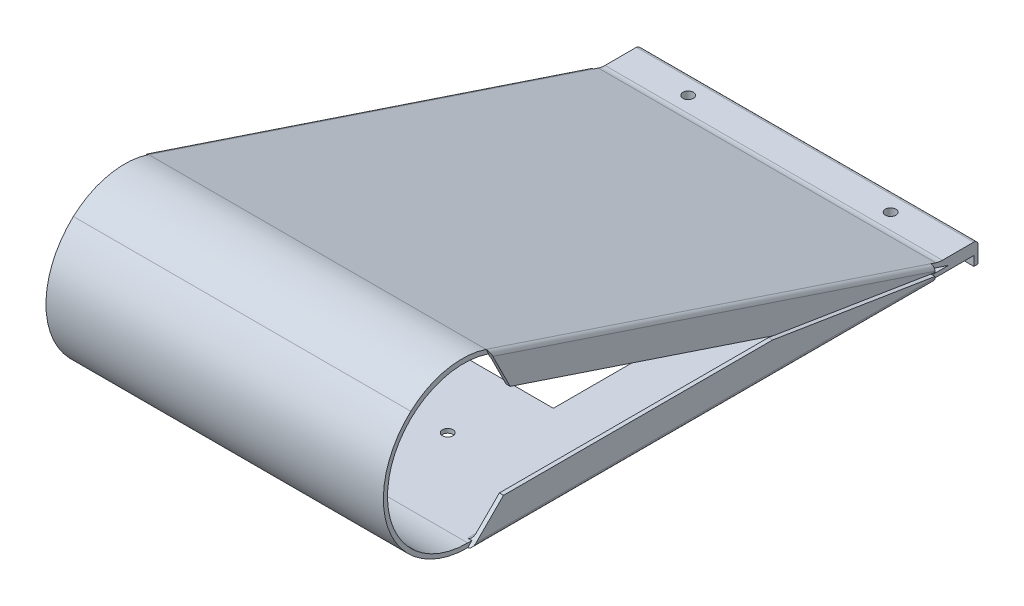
ISO-10303-21;
HEADER;
FILE_DESCRIPTION(('STEP AP214'),'2;1');
FILE_NAME('part.step','',(''),(''),'','','');
FILE_SCHEMA(('AUTOMOTIVE_DESIGN { 1 0 10303 214 1 1 1 1 }'));
ENDSEC;
DATA;
#1=APPLICATION_CONTEXT('core data for automotive mechanical design processes');
#2=APPLICATION_PROTOCOL_DEFINITION('international standard','automotive_design',2000,#1);
#3=PRODUCT_CONTEXT('',#1,'mechanical');
#4=PRODUCT('Part','Part','',(#3));
#5=PRODUCT_RELATED_PRODUCT_CATEGORY('part','',(#4));
#6=PRODUCT_DEFINITION_FORMATION('','',#4);
#7=PRODUCT_DEFINITION_CONTEXT('part definition',#1,'design');
#8=PRODUCT_DEFINITION('design','',#6,#7);
#9=PRODUCT_DEFINITION_SHAPE('','',#8);
#10=(LENGTH_UNIT() NAMED_UNIT(*) SI_UNIT(.MILLI.,.METRE.));
#11=(NAMED_UNIT(*) PLANE_ANGLE_UNIT() SI_UNIT($,.RADIAN.));
#12=(NAMED_UNIT(*) SI_UNIT($,.STERADIAN.) SOLID_ANGLE_UNIT());
#13=UNCERTAINTY_MEASURE_WITH_UNIT(LENGTH_MEASURE(1.E-05),#10,'distance_accuracy_value','');
#14=(GEOMETRIC_REPRESENTATION_CONTEXT(3) GLOBAL_UNCERTAINTY_ASSIGNED_CONTEXT((#13)) GLOBAL_UNIT_ASSIGNED_CONTEXT((#10,
#11,#12)) REPRESENTATION_CONTEXT('',''));
#15=CARTESIAN_POINT('',(0.,0.,0.));
#16=DIRECTION('',(0.,0.,1.));
#17=DIRECTION('',(1.,0.,0.));
#18=AXIS2_PLACEMENT_3D('',#15,#16,#17);
#19=CARTESIAN_POINT('',(50.8,0.,0.));
#20=DIRECTION('',(1.,0.,0.));
#21=DIRECTION('',(0.,0.,-1.));
#22=AXIS2_PLACEMENT_3D('',#19,#20,#21);
#23=PLANE('',#22);
#24=CARTESIAN_POINT('',(50.8,-15.5493048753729,-142.928377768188));
#25=DIRECTION('',(1.,0.,0.));
#26=DIRECTION('',(0.,0.,-1.));
#27=AXIS2_PLACEMENT_3D('',#24,#25,#26);
#28=CIRCLE('',#27,6.35025402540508);
#29=CARTESIAN_POINT('',(50.8,-21.8993048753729,-142.985177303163));
#30=VERTEX_POINT('',#29);
#31=CARTESIAN_POINT('',(50.8,-21.5736848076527,-140.920251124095));
#32=VERTEX_POINT('',#31);
#33=EDGE_CURVE('E957',#30,#32,#28,.F.);
#34=ORIENTED_EDGE('',*,*,#33,.T.);
#35=DIRECTION('',(0.,-0.316227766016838,-0.948683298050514));
#36=VECTOR('',#35,1.);
#37=CARTESIAN_POINT('',(50.8,-21.5736848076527,-140.920251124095));
#38=LINE('',#37,#36);
#39=CARTESIAN_POINT('',(50.8,-21.0822677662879,-139.446));
#40=VERTEX_POINT('',#39);
#41=EDGE_CURVE('E960',#32,#40,#38,.F.);
#42=ORIENTED_EDGE('',*,*,#41,.T.);
#43=DIRECTION('',(0.,-1.,0.));
#44=VECTOR('',#43,1.);
#45=CARTESIAN_POINT('',(50.8,-21.082,-139.446));
#46=LINE('',#45,#44);
#47=CARTESIAN_POINT('',(50.8,-22.3939235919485,-139.446));
#48=VERTEX_POINT('',#47);
#49=EDGE_CURVE('E471',#40,#48,#46,.T.);
#50=ORIENTED_EDGE('',*,*,#49,.T.);
#51=DIRECTION('',(0.,0.316227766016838,0.948683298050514));
#52=VECTOR('',#51,1.);
#53=CARTESIAN_POINT('',(50.8,24.1545761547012,0.199499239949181));
#54=LINE('',#53,#52);
#55=CARTESIAN_POINT('',(50.8,-24.1554,-144.730429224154));
#56=VERTEX_POINT('',#55);
#57=EDGE_CURVE('E742',#56,#48,#54,.T.);
#58=ORIENTED_EDGE('',*,*,#57,.F.);
#59=DIRECTION('',(0.,0.,-1.));
#60=VECTOR('',#59,1.);
#61=CARTESIAN_POINT('',(50.8,-24.1554,-144.730429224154));
#62=LINE('',#61,#60);
#63=CARTESIAN_POINT('',(50.8,-24.1554,-139.446));
#64=VERTEX_POINT('',#63);
#65=EDGE_CURVE('E735',#64,#56,#62,.T.);
#66=ORIENTED_EDGE('',*,*,#65,.F.);
#67=DIRECTION('',(0.,-1.,0.));
#68=VECTOR('',#67,1.);
#69=CARTESIAN_POINT('',(50.8,-23.7555446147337,-139.446));
#70=LINE('',#69,#68);
#71=CARTESIAN_POINT('',(50.8,-25.3997459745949,-139.446));
#72=VERTEX_POINT('',#71);
#73=EDGE_CURVE('E506',#64,#72,#70,.T.);
#74=ORIENTED_EDGE('',*,*,#73,.T.);
#75=DIRECTION('',(0.,0.,-1.));
#76=VECTOR('',#75,1.);
#77=CARTESIAN_POINT('',(50.8,-25.3997459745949,-139.446));
#78=LINE('',#77,#76);
#79=CARTESIAN_POINT('',(50.8,-25.3997459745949,-152.4));
#80=VERTEX_POINT('',#79);
#81=EDGE_CURVE('E953',#72,#80,#78,.T.);
#82=ORIENTED_EDGE('',*,*,#81,.T.);
#83=DIRECTION('',(0.,-1.,0.));
#84=VECTOR('',#83,1.);
#85=CARTESIAN_POINT('',(50.8,-21.8993048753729,-152.4));
#86=LINE('',#85,#84);
#87=CARTESIAN_POINT('',(50.8,-28.2493048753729,-152.4));
#88=VERTEX_POINT('',#87);
#89=EDGE_CURVE('E607',#80,#88,#86,.T.);
#90=ORIENTED_EDGE('',*,*,#89,.T.);
#91=DIRECTION('',(0.,0.,1.));
#92=VECTOR('',#91,1.);
#93=CARTESIAN_POINT('',(50.8,-28.2493048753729,-153.6446));
#94=LINE('',#93,#92);
#95=CARTESIAN_POINT('',(50.8,-28.2493048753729,-153.6446));
#96=VERTEX_POINT('',#95);
#97=EDGE_CURVE('E632',#96,#88,#94,.T.);
#98=ORIENTED_EDGE('',*,*,#97,.F.);
#99=DIRECTION('',(0.,-1.,0.));
#100=VECTOR('',#99,1.);
#101=CARTESIAN_POINT('',(50.8,-21.8993048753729,-153.6446));
#102=LINE('',#101,#100);
#103=CARTESIAN_POINT('',(50.8,-23.1693048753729,-153.6446));
#104=VERTEX_POINT('',#103);
#105=EDGE_CURVE('E608',#104,#96,#102,.T.);
#106=ORIENTED_EDGE('',*,*,#105,.F.);
#107=CARTESIAN_POINT('',(50.8,-23.1693048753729,-152.3746));
#108=DIRECTION('',(1.,0.,0.));
#109=DIRECTION('',(0.,0.,-1.));
#110=AXIS2_PLACEMENT_3D('',#107,#108,#109);
#111=CIRCLE('',#110,1.27);
#112=CARTESIAN_POINT('',(50.8,-21.8993048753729,-152.3746));
#113=VERTEX_POINT('',#112);
#114=EDGE_CURVE('E873',#104,#113,#111,.T.);
#115=ORIENTED_EDGE('',*,*,#114,.T.);
#116=DIRECTION('',(0.,0.,1.));
#117=VECTOR('',#116,1.);
#118=CARTESIAN_POINT('',(50.8,-21.8993048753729,-141.897914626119));
#119=LINE('',#118,#117);
#120=EDGE_CURVE('E750',#113,#30,#119,.T.);
#121=ORIENTED_EDGE('',*,*,#120,.T.);
#122=EDGE_LOOP('',(#34,#42,#50,#58,#66,#74,#82,#90,#98,#106,#115,#121));
#123=FACE_BOUND('',#122,.T.);
#124=ADVANCED_FACE('F47',(#123),#23,.T.);
#125=DIRECTION('',(0.,0.894427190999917,0.447213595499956));
#126=VECTOR('',#125,1.);
#127=CARTESIAN_POINT('',(50.8,23.5616074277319,-5.51517771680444));
#128=LINE('',#127,#126);
#129=CARTESIAN_POINT('',(50.8,21.9872991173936,-6.30233187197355));
#130=VERTEX_POINT('',#129);
#131=CARTESIAN_POINT('',(50.8,23.5612861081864,-5.51533837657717));
#132=VERTEX_POINT('',#131);
#133=EDGE_CURVE('E475',#130,#132,#128,.T.);
#134=ORIENTED_EDGE('',*,*,#133,.T.);
#135=DIRECTION('',(0.,-0.316227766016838,-0.948683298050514));
#136=VECTOR('',#135,1.);
#137=CARTESIAN_POINT('',(50.8,23.5612861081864,-5.51533837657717));
#138=LINE('',#137,#136);
#139=CARTESIAN_POINT('',(50.8,23.5954457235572,-5.41285953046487));
#140=VERTEX_POINT('',#139);
#141=EDGE_CURVE('E1060',#132,#140,#138,.F.);
#142=ORIENTED_EDGE('',*,*,#141,.T.);
#143=CARTESIAN_POINT('',(50.8,1.8747072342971,1.71378901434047));
#144=DIRECTION('',(1.,0.,0.));
#145=DIRECTION('',(0.,0.,-1.));
#146=AXIS2_PLACEMENT_3D('',#143,#144,#145);
#147=CIRCLE('',#146,22.86);
#148=CARTESIAN_POINT('',(50.8,18.7470723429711,17.1378901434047));
#149=VERTEX_POINT('',#148);
#150=EDGE_CURVE('E799',#140,#149,#147,.T.);
#151=ORIENTED_EDGE('',*,*,#150,.T.);
#152=CARTESIAN_POINT('',(50.8,0.,0.));
#153=DIRECTION('',(1.,0.,0.));
#154=DIRECTION('',(0.,0.,-1.));
#155=AXIS2_PLACEMENT_3D('',#152,#153,#154);
#156=CIRCLE('',#155,25.4);
#157=CARTESIAN_POINT('',(50.8,-25.3997459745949,0.113597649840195));
#158=VERTEX_POINT('',#157);
#159=EDGE_CURVE('E746',#149,#158,#156,.T.);
#160=ORIENTED_EDGE('',*,*,#159,.T.);
#161=DIRECTION('',(0.,0.,-1.));
#162=VECTOR('',#161,1.);
#163=CARTESIAN_POINT('',(50.8,-25.3997459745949,0.113597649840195));
#164=LINE('',#163,#162);
#165=CARTESIAN_POINT('',(50.8,-25.3997459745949,-0.000254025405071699));
#166=VERTEX_POINT('',#165);
#167=EDGE_CURVE('E1298',#158,#166,#164,.T.);
#168=ORIENTED_EDGE('',*,*,#167,.T.);
#169=DIRECTION('',(0.,0.707106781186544,-0.707106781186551));
#170=VECTOR('',#169,1.);
#171=CARTESIAN_POINT('',(50.8,-25.4,0.));
#172=LINE('',#171,#170);
#173=CARTESIAN_POINT('',(50.8,-24.1554,-1.24460000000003));
#174=VERTEX_POINT('',#173);
#175=EDGE_CURVE('E494',#166,#174,#172,.T.);
#176=ORIENTED_EDGE('',*,*,#175,.T.);
#177=CARTESIAN_POINT('',(50.8,-24.1554,0.));
#178=VERTEX_POINT('',#177);
#179=EDGE_CURVE('E737',#178,#174,#62,.T.);
#180=ORIENTED_EDGE('',*,*,#179,.F.);
#181=CARTESIAN_POINT('',(50.8,0.,0.));
#182=DIRECTION('',(1.,0.,0.));
#183=DIRECTION('',(0.,0.,-1.));
#184=AXIS2_PLACEMENT_3D('',#181,#182,#183);
#185=CIRCLE('',#184,24.1554);
#186=CARTESIAN_POINT('',(50.8,7.49615724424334,22.9628172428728));
#187=VERTEX_POINT('',#186);
#188=EDGE_CURVE('E732',#187,#178,#185,.T.);
#189=ORIENTED_EDGE('',*,*,#188,.F.);
#190=CARTESIAN_POINT('',(50.8,0.402002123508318,1.23144445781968));
#191=DIRECTION('',(1.,0.,0.));
#192=DIRECTION('',(0.,0.,-1.));
#193=AXIS2_PLACEMENT_3D('',#190,#191,#192);
#194=CIRCLE('',#193,22.86);
#195=CARTESIAN_POINT('',(50.8,22.0889023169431,-5.99752227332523));
#196=VERTEX_POINT('',#195);
#197=EDGE_CURVE('E817',#187,#196,#194,.F.);
#198=ORIENTED_EDGE('',*,*,#197,.T.);
#199=EDGE_CURVE('E741',#130,#196,#54,.T.);
#200=ORIENTED_EDGE('',*,*,#199,.F.);
#201=EDGE_LOOP('',(#134,#142,#151,#160,#168,#176,#180,#189,#198,#200));
#202=FACE_BOUND('',#201,.T.);
#203=ADVANCED_FACE('F1111',(#202),#23,.T.);
#204=CARTESIAN_POINT('',(-50.8,0.,0.));
#205=DIRECTION('',(1.,0.,0.));
#206=DIRECTION('',(0.,0.,-1.));
#207=AXIS2_PLACEMENT_3D('',#204,#205,#206);
#208=PLANE('',#207);
#209=DIRECTION('',(0.,1.,0.));
#210=VECTOR('',#209,1.);
#211=CARTESIAN_POINT('',(-50.8,-24.1554,-152.4));
#212=LINE('',#211,#210);
#213=CARTESIAN_POINT('',(-50.8,-25.3997459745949,-152.4));
#214=VERTEX_POINT('',#213);
#215=CARTESIAN_POINT('',(-50.8,-21.899558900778,-152.4));
#216=VERTEX_POINT('',#215);
#217=EDGE_CURVE('E780',#214,#216,#212,.T.);
#218=ORIENTED_EDGE('',*,*,#217,.F.);
#219=DIRECTION('',(0.,0.,-1.));
#220=VECTOR('',#219,1.);
#221=CARTESIAN_POINT('',(-50.8,-25.3997459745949,-152.4));
#222=LINE('',#221,#220);
#223=CARTESIAN_POINT('',(-50.8,-25.3997459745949,-139.446));
#224=VERTEX_POINT('',#223);
#225=EDGE_CURVE('E1141',#214,#224,#222,.F.);
#226=ORIENTED_EDGE('',*,*,#225,.T.);
#227=DIRECTION('',(0.,-1.,0.));
#228=VECTOR('',#227,1.);
#229=CARTESIAN_POINT('',(-50.8,-23.7555446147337,-139.446));
#230=LINE('',#229,#228);
#231=CARTESIAN_POINT('',(-50.8,-24.1554,-139.446));
#232=VERTEX_POINT('',#231);
#233=EDGE_CURVE('E511',#232,#224,#230,.T.);
#234=ORIENTED_EDGE('',*,*,#233,.F.);
#235=DIRECTION('',(0.,0.,-1.));
#236=VECTOR('',#235,1.);
#237=CARTESIAN_POINT('',(-50.8,-24.1554,-144.730429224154));
#238=LINE('',#237,#236);
#239=CARTESIAN_POINT('',(-50.8,-24.1554,-144.730429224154));
#240=VERTEX_POINT('',#239);
#241=EDGE_CURVE('E757',#232,#240,#238,.T.);
#242=ORIENTED_EDGE('',*,*,#241,.T.);
#243=DIRECTION('',(0.,0.316227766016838,0.948683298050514));
#244=VECTOR('',#243,1.);
#245=CARTESIAN_POINT('',(-50.8,24.1545761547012,0.199499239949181));
#246=LINE('',#245,#244);
#247=CARTESIAN_POINT('',(-50.8,-22.3939235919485,-139.446));
#248=VERTEX_POINT('',#247);
#249=EDGE_CURVE('E763',#240,#248,#246,.T.);
#250=ORIENTED_EDGE('',*,*,#249,.T.);
#251=DIRECTION('',(0.,-1.,0.));
#252=VECTOR('',#251,1.);
#253=CARTESIAN_POINT('',(-50.8,-21.082,-139.446));
#254=LINE('',#253,#252);
#255=CARTESIAN_POINT('',(-50.8,-21.0822677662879,-139.446));
#256=VERTEX_POINT('',#255);
#257=EDGE_CURVE('E555',#256,#248,#254,.T.);
#258=ORIENTED_EDGE('',*,*,#257,.F.);
#259=DIRECTION('',(0.,-0.316227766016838,-0.948683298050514));
#260=VECTOR('',#259,1.);
#261=CARTESIAN_POINT('',(-50.8,-21.0822677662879,-139.446));
#262=LINE('',#261,#260);
#263=CARTESIAN_POINT('',(-50.8,-21.5736848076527,-140.920251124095));
#264=VERTEX_POINT('',#263);
#265=EDGE_CURVE('E1152',#256,#264,#262,.T.);
#266=ORIENTED_EDGE('',*,*,#265,.T.);
#267=CARTESIAN_POINT('',(-50.8,-15.5493048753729,-142.928377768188));
#268=DIRECTION('',(-1.,0.,0.));
#269=DIRECTION('',(0.,0.,1.));
#270=AXIS2_PLACEMENT_3D('',#267,#268,#269);
#271=CIRCLE('',#270,6.35025402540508);
#272=CARTESIAN_POINT('',(-50.8,-21.8993048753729,-142.985177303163));
#273=VERTEX_POINT('',#272);
#274=EDGE_CURVE('E1158',#264,#273,#271,.F.);
#275=ORIENTED_EDGE('',*,*,#274,.T.);
#276=DIRECTION('',(0.,0.,1.));
#277=VECTOR('',#276,1.);
#278=CARTESIAN_POINT('',(-50.8,-21.8993048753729,-141.897914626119));
#279=LINE('',#278,#277);
#280=CARTESIAN_POINT('',(-50.8,-21.8993048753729,-152.3746));
#281=VERTEX_POINT('',#280);
#282=EDGE_CURVE('E783',#281,#273,#279,.T.);
#283=ORIENTED_EDGE('',*,*,#282,.F.);
#284=CARTESIAN_POINT('',(-50.8,-23.1693048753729,-152.3746));
#285=DIRECTION('',(1.,0.,0.));
#286=DIRECTION('',(0.,0.,-1.));
#287=AXIS2_PLACEMENT_3D('',#284,#285,#286);
#288=CIRCLE('',#287,1.27);
#289=EDGE_CURVE('E879',#281,#216,#288,.F.);
#290=ORIENTED_EDGE('',*,*,#289,.T.);
#291=EDGE_LOOP('',(#218,#226,#234,#242,#250,#258,#266,#275,#283,#290));
#292=FACE_BOUND('',#291,.T.);
#293=ADVANCED_FACE('F1118',(#292),#208,.F.);
#294=DIRECTION('',(0.,0.707106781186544,-0.707106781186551));
#295=VECTOR('',#294,1.);
#296=CARTESIAN_POINT('',(-50.8,-25.4,0.));
#297=LINE('',#296,#295);
#298=CARTESIAN_POINT('',(-50.8,-25.3997459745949,-0.000254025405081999));
#299=VERTEX_POINT('',#298);
#300=CARTESIAN_POINT('',(-50.8,-24.1554,-1.24460000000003));
#301=VERTEX_POINT('',#300);
#302=EDGE_CURVE('E585',#299,#301,#297,.T.);
#303=ORIENTED_EDGE('',*,*,#302,.F.);
#304=DIRECTION('',(0.,0.,-1.));
#305=VECTOR('',#304,1.);
#306=CARTESIAN_POINT('',(-50.8,-25.3997459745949,-0.00025402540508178));
#307=LINE('',#306,#305);
#308=CARTESIAN_POINT('',(-50.8,-25.3997459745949,0.113597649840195));
#309=VERTEX_POINT('',#308);
#310=EDGE_CURVE('E1225',#299,#309,#307,.F.);
#311=ORIENTED_EDGE('',*,*,#310,.T.);
#312=CARTESIAN_POINT('',(-50.8,0.,0.));
#313=DIRECTION('',(1.,0.,0.));
#314=DIRECTION('',(0.,0.,-1.));
#315=AXIS2_PLACEMENT_3D('',#312,#313,#314);
#316=CIRCLE('',#315,25.4);
#317=CARTESIAN_POINT('',(-50.8,18.7470723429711,17.1378901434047));
#318=VERTEX_POINT('',#317);
#319=EDGE_CURVE('E772',#318,#309,#316,.T.);
#320=ORIENTED_EDGE('',*,*,#319,.F.);
#321=CARTESIAN_POINT('',(-50.8,1.8747072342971,1.71378901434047));
#322=DIRECTION('',(1.,0.,0.));
#323=DIRECTION('',(0.,0.,-1.));
#324=AXIS2_PLACEMENT_3D('',#321,#322,#323);
#325=CIRCLE('',#324,22.86);
#326=CARTESIAN_POINT('',(-50.8,23.5954457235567,-5.4128595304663));
#327=VERTEX_POINT('',#326);
#328=EDGE_CURVE('E805',#318,#327,#325,.F.);
#329=ORIENTED_EDGE('',*,*,#328,.T.);
#330=DIRECTION('',(0.,-0.316227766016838,-0.948683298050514));
#331=VECTOR('',#330,1.);
#332=CARTESIAN_POINT('',(-50.8,23.5954457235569,-5.41285953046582));
#333=LINE('',#332,#331);
#334=CARTESIAN_POINT('',(-50.8,23.5612861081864,-5.51533837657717));
#335=VERTEX_POINT('',#334);
#336=EDGE_CURVE('E1230',#327,#335,#333,.T.);
#337=ORIENTED_EDGE('',*,*,#336,.T.);
#338=DIRECTION('',(0.,0.894427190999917,0.447213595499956));
#339=VECTOR('',#338,1.);
#340=CARTESIAN_POINT('',(-50.8,23.5616074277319,-5.51517771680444));
#341=LINE('',#340,#339);
#342=CARTESIAN_POINT('',(-50.8,21.9872991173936,-6.30233187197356));
#343=VERTEX_POINT('',#342);
#344=EDGE_CURVE('E549',#343,#335,#341,.T.);
#345=ORIENTED_EDGE('',*,*,#344,.F.);
#346=CARTESIAN_POINT('',(-50.8,22.0889023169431,-5.99752227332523));
#347=VERTEX_POINT('',#346);
#348=EDGE_CURVE('E762',#343,#347,#246,.T.);
#349=ORIENTED_EDGE('',*,*,#348,.T.);
#350=CARTESIAN_POINT('',(-50.8,0.402002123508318,1.23144445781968));
#351=DIRECTION('',(1.,0.,0.));
#352=DIRECTION('',(0.,0.,-1.));
#353=AXIS2_PLACEMENT_3D('',#350,#351,#352);
#354=CIRCLE('',#353,22.86);
#355=CARTESIAN_POINT('',(-50.8,7.49615724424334,22.9628172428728));
#356=VERTEX_POINT('',#355);
#357=EDGE_CURVE('E821',#347,#356,#354,.T.);
#358=ORIENTED_EDGE('',*,*,#357,.T.);
#359=CARTESIAN_POINT('',(-50.8,0.,0.));
#360=DIRECTION('',(1.,0.,0.));
#361=DIRECTION('',(0.,0.,-1.));
#362=AXIS2_PLACEMENT_3D('',#359,#360,#361);
#363=CIRCLE('',#362,24.1554);
#364=CARTESIAN_POINT('',(-50.8,-24.1554,0.));
#365=VERTEX_POINT('',#364);
#366=EDGE_CURVE('E754',#356,#365,#363,.T.);
#367=ORIENTED_EDGE('',*,*,#366,.T.);
#368=EDGE_CURVE('E758',#365,#301,#238,.T.);
#369=ORIENTED_EDGE('',*,*,#368,.T.);
#370=EDGE_LOOP('',(#303,#311,#320,#329,#337,#345,#349,#358,#367,#369));
#371=FACE_BOUND('',#370,.T.);
#372=ADVANCED_FACE('F1132',(#371),#208,.F.);
#373=CARTESIAN_POINT('',(-28.575,-22.544,-136.525));
#374=DIRECTION('',(0.,0.,-1.));
#375=DIRECTION('',(0.,1.,0.));
#376=AXIS2_PLACEMENT_3D('',#373,#374,#375);
#377=PLANE('',#376);
#378=DIRECTION('',(1.,0.,0.));
#379=VECTOR('',#378,1.);
#380=CARTESIAN_POINT('',(-28.575,-25.4,-136.525));
#381=LINE('',#380,#379);
#382=CARTESIAN_POINT('',(-28.575,-25.4,-136.525));
#383=VERTEX_POINT('',#382);
#384=CARTESIAN_POINT('',(-22.225,-25.4,-136.525));
#385=VERTEX_POINT('',#384);
#386=EDGE_CURVE('E697',#383,#385,#381,.T.);
#387=ORIENTED_EDGE('',*,*,#386,.T.);
#388=DIRECTION('',(0.,-1.,0.));
#389=VECTOR('',#388,1.);
#390=CARTESIAN_POINT('',(-22.225,-24.1554,-136.525));
#391=LINE('',#390,#389);
#392=CARTESIAN_POINT('',(-22.225,-24.1554,-136.525));
#393=VERTEX_POINT('',#392);
#394=EDGE_CURVE('E658',#393,#385,#391,.T.);
#395=ORIENTED_EDGE('',*,*,#394,.F.);
#396=DIRECTION('',(1.,0.,0.));
#397=VECTOR('',#396,1.);
#398=CARTESIAN_POINT('',(-50.8,-24.1554,-136.525));
#399=LINE('',#398,#397);
#400=CARTESIAN_POINT('',(-28.575,-24.1554,-136.525));
#401=VERTEX_POINT('',#400);
#402=EDGE_CURVE('E855',#401,#393,#399,.T.);
#403=ORIENTED_EDGE('',*,*,#402,.F.);
#404=DIRECTION('',(0.,-1.,0.));
#405=VECTOR('',#404,1.);
#406=CARTESIAN_POINT('',(-28.575,-22.544,-136.525));
#407=LINE('',#406,#405);
#408=EDGE_CURVE('E707',#401,#383,#407,.T.);
#409=ORIENTED_EDGE('',*,*,#408,.T.);
#410=EDGE_LOOP('',(#387,#395,#403,#409));
#411=FACE_BOUND('',#410,.T.);
#412=ADVANCED_FACE('F1009',(#411),#377,.F.);
#413=CARTESIAN_POINT('',(-50.8,0.,0.));
#414=DIRECTION('',(1.,0.,0.));
#415=DIRECTION('',(0.,0.,-1.));
#416=AXIS2_PLACEMENT_3D('',#413,#414,#415);
#417=CYLINDRICAL_SURFACE('',#416,25.4);
#418=DIRECTION('',(1.,0.,0.));
#419=VECTOR('',#418,1.);
#420=CARTESIAN_POINT('',(-50.8,-25.4,0.));
#421=LINE('',#420,#419);
#422=CARTESIAN_POINT('',(-50.7746,-25.4,0.));
#423=VERTEX_POINT('',#422);
#424=CARTESIAN_POINT('',(50.7746,-25.4,0.));
#425=VERTEX_POINT('',#424);
#426=EDGE_CURVE('E787',#423,#425,#421,.T.);
#427=ORIENTED_EDGE('',*,*,#426,.T.);
#428=CARTESIAN_POINT('',(50.8,-25.3997459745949,0.113597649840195));
#429=CARTESIAN_POINT('',(50.793852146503,-25.3998689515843,0.086100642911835));
#430=CARTESIAN_POINT('',(50.7877040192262,-25.3999472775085,0.0586036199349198));
#431=CARTESIAN_POINT('',(50.7792371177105,-25.3999936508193,0.0207377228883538));
#432=CARTESIAN_POINT('',(50.7769185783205,-25.4000000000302,0.0103688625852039));
#433=CARTESIAN_POINT('',(50.7746,-25.4,0.));
#434=B_SPLINE_CURVE_WITH_KNOTS('',3,(#428,#429,#430,#431,#432,#433),.UNSPECIFIED.,.F.,.F.,(4,2,
4),(0.,0.0845282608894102,0.116403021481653),.UNSPECIFIED.);
#435=EDGE_CURVE('E1024',#425,#158,#434,.F.);
#436=ORIENTED_EDGE('',*,*,#435,.T.);
#437=ORIENTED_EDGE('',*,*,#159,.F.);
#438=DIRECTION('',(1.,0.,0.));
#439=VECTOR('',#438,1.);
#440=CARTESIAN_POINT('',(-50.8,18.7470723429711,17.1378901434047));
#441=LINE('',#440,#439);
#442=EDGE_CURVE('E802',#149,#318,#441,.F.);
#443=ORIENTED_EDGE('',*,*,#442,.T.);
#444=ORIENTED_EDGE('',*,*,#319,.T.);
#445=CARTESIAN_POINT('',(-50.8,-25.3997459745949,0.113597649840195));
#446=CARTESIAN_POINT('',(-50.7938521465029,-25.3998689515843,0.0861006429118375));
#447=CARTESIAN_POINT('',(-50.7877040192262,-25.3999472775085,0.0586036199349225));
#448=CARTESIAN_POINT('',(-50.7792371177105,-25.3999936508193,0.0207377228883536));
#449=CARTESIAN_POINT('',(-50.7769185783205,-25.4000000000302,0.0103688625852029));
#450=CARTESIAN_POINT('',(-50.7746,-25.4,0.));
#451=B_SPLINE_CURVE_WITH_KNOTS('',3,(#445,#446,#447,#448,#449,#450),.UNSPECIFIED.,.F.,.F.,(4,2,
4),(0.,0.0845282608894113,0.116403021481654),.UNSPECIFIED.);
#452=EDGE_CURVE('E1016',#309,#423,#451,.T.);
#453=ORIENTED_EDGE('',*,*,#452,.T.);
#454=EDGE_LOOP('',(#427,#436,#437,#443,#444,#453));
#455=FACE_BOUND('',#454,.T.);
#456=ADVANCED_FACE('F1005',(#455),#417,.T.);
#457=CARTESIAN_POINT('',(-50.8,25.4,0.));
#458=DIRECTION('',(0.,0.948683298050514,-0.316227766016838));
#459=DIRECTION('',(0.,0.316227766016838,0.948683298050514));
#460=AXIS2_PLACEMENT_3D('',#457,#458,#459);
#461=PLANE('',#460);
#462=DIRECTION('',(1.,0.,0.));
#463=VECTOR('',#462,1.);
#464=CARTESIAN_POINT('',(-50.8,23.5616074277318,-5.51517771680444));
#465=LINE('',#464,#463);
#466=CARTESIAN_POINT('',(-50.7746,23.5616074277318,-5.51517771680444));
#467=VERTEX_POINT('',#466);
#468=CARTESIAN_POINT('',(50.7746,23.5616074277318,-5.51517771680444));
#469=VERTEX_POINT('',#468);
#470=EDGE_CURVE('E791',#467,#469,#465,.T.);
#471=ORIENTED_EDGE('',*,*,#470,.T.);
#472=DIRECTION('',(0.,-0.316227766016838,-0.948683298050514));
#473=VECTOR('',#472,1.);
#474=CARTESIAN_POINT('',(50.7746,25.4,0.));
#475=LINE('',#474,#473);
#476=CARTESIAN_POINT('',(50.7746,-21.5734438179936,-140.920331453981));
#477=VERTEX_POINT('',#476);
#478=EDGE_CURVE('E949',#469,#477,#475,.T.);
#479=ORIENTED_EDGE('',*,*,#478,.T.);
#480=DIRECTION('',(1.,0.,0.));
#481=VECTOR('',#480,1.);
#482=CARTESIAN_POINT('',(-50.8,-21.5734438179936,-140.920331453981));
#483=LINE('',#482,#481);
#484=CARTESIAN_POINT('',(-50.7746,-21.5734438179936,-140.920331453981));
#485=VERTEX_POINT('',#484);
#486=EDGE_CURVE('E828',#477,#485,#483,.F.);
#487=ORIENTED_EDGE('',*,*,#486,.T.);
#488=DIRECTION('',(0.,-0.316227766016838,-0.948683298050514));
#489=VECTOR('',#488,1.);
#490=CARTESIAN_POINT('',(-50.7746,25.4,0.));
#491=LINE('',#490,#489);
#492=EDGE_CURVE('E946',#485,#467,#491,.F.);
#493=ORIENTED_EDGE('',*,*,#492,.T.);
#494=EDGE_LOOP('',(#471,#479,#487,#493));
#495=FACE_BOUND('',#494,.T.);
#496=ADVANCED_FACE('F993',(#495),#461,.T.);
#497=CARTESIAN_POINT('',(-50.8,-21.8993048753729,-141.897914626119));
#498=DIRECTION('',(0.,1.,0.));
#499=DIRECTION('',(0.,0.,1.));
#500=AXIS2_PLACEMENT_3D('',#497,#498,#499);
#501=PLANE('',#500);
#502=CARTESIAN_POINT('',(30.48,-21.8993048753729,-147.664188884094));
#503=DIRECTION('',(0.,1.,0.));
#504=DIRECTION('',(0.,0.,1.));
#505=AXIS2_PLACEMENT_3D('',#502,#503,#504);
#506=CIRCLE('',#505,1.5875);
#507=CARTESIAN_POINT('',(30.48,-21.8993048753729,-146.076688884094));
#508=VERTEX_POINT('',#507);
#509=EDGE_CURVE('E676',#508,#508,#506,.T.);
#510=ORIENTED_EDGE('',*,*,#509,.F.);
#511=EDGE_LOOP('',(#510));
#512=FACE_BOUND('',#511,.T.);
#513=CARTESIAN_POINT('',(-30.48,-21.8993048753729,-147.664188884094));
#514=DIRECTION('',(0.,1.,0.));
#515=DIRECTION('',(0.,0.,1.));
#516=AXIS2_PLACEMENT_3D('',#513,#514,#515);
#517=CIRCLE('',#516,1.5875);
#518=CARTESIAN_POINT('',(-30.48,-21.8993048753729,-146.076688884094));
#519=VERTEX_POINT('',#518);
#520=EDGE_CURVE('E675',#519,#519,#517,.T.);
#521=ORIENTED_EDGE('',*,*,#520,.F.);
#522=EDGE_LOOP('',(#521));
#523=FACE_BOUND('',#522,.T.);
#524=DIRECTION('',(1.,0.,0.));
#525=VECTOR('',#524,1.);
#526=CARTESIAN_POINT('',(50.8,-21.8993048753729,-142.928377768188));
#527=LINE('',#526,#525);
#528=CARTESIAN_POINT('',(-50.7746,-21.8993048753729,-142.928377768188));
#529=VERTEX_POINT('',#528);
#530=CARTESIAN_POINT('',(50.7746,-21.8993048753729,-142.928377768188));
#531=VERTEX_POINT('',#530);
#532=EDGE_CURVE('E824',#529,#531,#527,.T.);
#533=ORIENTED_EDGE('',*,*,#532,.T.);
#534=CARTESIAN_POINT('',(50.8,-21.8993048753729,-142.985177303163));
#535=CARTESIAN_POINT('',(50.7937024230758,-21.8993048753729,-142.971093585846));
#536=CARTESIAN_POINT('',(50.7874045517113,-21.8993048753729,-142.9570100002));
#537=CARTESIAN_POINT('',(50.7789376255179,-21.8993048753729,-142.938076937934));
#538=CARTESIAN_POINT('',(50.7767688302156,-21.8993048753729,-142.933227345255));
#539=CARTESIAN_POINT('',(50.7746,-21.8993048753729,-142.928377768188));
#540=B_SPLINE_CURVE_WITH_KNOTS('',3,(#534,#535,#536,#537,#538,#539),.UNSPECIFIED.,.F.,.F.,(4,2,
4),(0.,0.0462827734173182,0.0622201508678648),.UNSPECIFIED.);
#541=EDGE_CURVE('E980',#531,#30,#540,.F.);
#542=ORIENTED_EDGE('',*,*,#541,.T.);
#543=ORIENTED_EDGE('',*,*,#120,.F.);
#544=DIRECTION('',(1.,0.,0.));
#545=VECTOR('',#544,1.);
#546=CARTESIAN_POINT('',(-50.8,-21.8993048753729,-152.3746));
#547=LINE('',#546,#545);
#548=EDGE_CURVE('E876',#113,#281,#547,.F.);
#549=ORIENTED_EDGE('',*,*,#548,.T.);
#550=ORIENTED_EDGE('',*,*,#282,.T.);
#551=CARTESIAN_POINT('',(-50.8,-21.8993048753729,-142.985177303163));
#552=CARTESIAN_POINT('',(-50.7937024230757,-21.8993048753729,-142.971093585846));
#553=CARTESIAN_POINT('',(-50.7874045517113,-21.8993048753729,-142.9570100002));
#554=CARTESIAN_POINT('',(-50.7789376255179,-21.8993048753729,-142.938076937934));
#555=CARTESIAN_POINT('',(-50.7767688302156,-21.8993048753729,-142.933227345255));
#556=CARTESIAN_POINT('',(-50.7746,-21.8993048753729,-142.928377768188));
#557=B_SPLINE_CURVE_WITH_KNOTS('',3,(#551,#552,#553,#554,#555,#556),.UNSPECIFIED.,.F.,.F.,(4,2,
4),(0.,0.0462827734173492,0.0622201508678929),.UNSPECIFIED.);
#558=EDGE_CURVE('E972',#273,#529,#557,.T.);
#559=ORIENTED_EDGE('',*,*,#558,.T.);
#560=EDGE_LOOP('',(#533,#542,#543,#549,#550,#559));
#561=FACE_BOUND('',#560,.T.);
#562=ADVANCED_FACE('F987',(#512,#523,#561),#501,.T.);
#563=CARTESIAN_POINT('',(-50.8,-21.8993048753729,-152.4));
#564=DIRECTION('',(0.,0.,-1.));
#565=DIRECTION('',(-1.,0.,0.));
#566=AXIS2_PLACEMENT_3D('',#563,#564,#565);
#567=PLANE('',#566);
#568=DIRECTION('',(0.,1.,0.));
#569=VECTOR('',#568,1.);
#570=CARTESIAN_POINT('',(-50.7746,-21.8993048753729,-152.4));
#571=LINE('',#570,#569);
#572=CARTESIAN_POINT('',(-50.7746,-25.4,-152.4));
#573=VERTEX_POINT('',#572);
#574=CARTESIAN_POINT('',(-50.7746,-21.899558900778,-152.4));
#575=VERTEX_POINT('',#574);
#576=EDGE_CURVE('E628',#573,#575,#571,.T.);
#577=ORIENTED_EDGE('',*,*,#576,.F.);
#578=CARTESIAN_POINT('',(-50.7746,-24.13,-152.4));
#579=DIRECTION('',(0.,0.,-1.));
#580=DIRECTION('',(-1.,0.,0.));
#581=AXIS2_PLACEMENT_3D('',#578,#579,#580);
#582=CIRCLE('',#581,1.27);
#583=EDGE_CURVE('E1148',#573,#214,#582,.T.);
#584=ORIENTED_EDGE('',*,*,#583,.T.);
#585=ORIENTED_EDGE('',*,*,#217,.T.);
#586=DIRECTION('',(1.,0.,0.));
#587=VECTOR('',#586,1.);
#588=CARTESIAN_POINT('',(-50.8,-21.899558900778,-152.4));
#589=LINE('',#588,#587);
#590=EDGE_CURVE('E883',#216,#575,#589,.T.);
#591=ORIENTED_EDGE('',*,*,#590,.T.);
#592=EDGE_LOOP('',(#577,#584,#585,#591));
#593=FACE_BOUND('',#592,.T.);
#594=ADVANCED_FACE('F992',(#593),#567,.T.);
#595=CARTESIAN_POINT('',(-50.8,-25.4,-152.4));
#596=DIRECTION('',(0.,-1.,0.));
#597=DIRECTION('',(0.,0.,-1.));
#598=AXIS2_PLACEMENT_3D('',#595,#596,#597);
#599=PLANE('',#598);
#600=DIRECTION('',(1.,0.,0.));
#601=VECTOR('',#600,1.);
#602=CARTESIAN_POINT('',(-50.8,-25.4,-152.4));
#603=LINE('',#602,#601);
#604=CARTESIAN_POINT('',(22.225,-25.4,-152.4));
#605=VERTEX_POINT('',#604);
#606=CARTESIAN_POINT('',(50.7746,-25.4,-152.4));
#607=VERTEX_POINT('',#606);
#608=EDGE_CURVE('E792',#605,#607,#603,.T.);
#609=ORIENTED_EDGE('',*,*,#608,.T.);
#610=DIRECTION('',(0.,0.,1.));
#611=VECTOR('',#610,1.);
#612=CARTESIAN_POINT('',(50.7746,-25.4,0.));
#613=LINE('',#612,#611);
#614=EDGE_CURVE('E1338',#607,#425,#613,.T.);
#615=ORIENTED_EDGE('',*,*,#614,.T.);
#616=ORIENTED_EDGE('',*,*,#426,.F.);
#617=DIRECTION('',(0.,0.,1.));
#618=VECTOR('',#617,1.);
#619=CARTESIAN_POINT('',(-50.7746,-25.4,-139.446));
#620=LINE('',#619,#618);
#621=EDGE_CURVE('E1068',#423,#573,#620,.F.);
#622=ORIENTED_EDGE('',*,*,#621,.T.);
#623=CARTESIAN_POINT('',(-22.225,-25.4,-152.4));
#624=VERTEX_POINT('',#623);
#625=EDGE_CURVE('E788',#573,#624,#603,.T.);
#626=ORIENTED_EDGE('',*,*,#625,.T.);
#627=DIRECTION('',(0.,0.,-1.));
#628=VECTOR('',#627,1.);
#629=CARTESIAN_POINT('',(-22.225,-25.4,-152.4));
#630=LINE('',#629,#628);
#631=EDGE_CURVE('E636',#385,#624,#630,.T.);
#632=ORIENTED_EDGE('',*,*,#631,.F.);
#633=ORIENTED_EDGE('',*,*,#386,.F.);
#634=DIRECTION('',(0.,0.,-1.));
#635=VECTOR('',#634,1.);
#636=CARTESIAN_POINT('',(-28.575,-25.4,-48.005));
#637=LINE('',#636,#635);
#638=CARTESIAN_POINT('',(-28.575,-25.4,-48.005));
#639=VERTEX_POINT('',#638);
#640=EDGE_CURVE('E692',#639,#383,#637,.T.);
#641=ORIENTED_EDGE('',*,*,#640,.F.);
#642=DIRECTION('',(-1.,0.,0.));
#643=VECTOR('',#642,1.);
#644=CARTESIAN_POINT('',(-28.575,-25.4,-48.005));
#645=LINE('',#644,#643);
#646=CARTESIAN_POINT('',(28.575,-25.4,-48.005));
#647=VERTEX_POINT('',#646);
#648=EDGE_CURVE('E687',#647,#639,#645,.T.);
#649=ORIENTED_EDGE('',*,*,#648,.F.);
#650=DIRECTION('',(0.,0.,1.));
#651=VECTOR('',#650,1.);
#652=CARTESIAN_POINT('',(28.575,-25.4,-48.005));
#653=LINE('',#652,#651);
#654=CARTESIAN_POINT('',(28.575,-25.4,-136.525));
#655=VERTEX_POINT('',#654);
#656=EDGE_CURVE('E684',#655,#647,#653,.T.);
#657=ORIENTED_EDGE('',*,*,#656,.F.);
#658=CARTESIAN_POINT('',(22.225,-25.4,-136.525));
#659=VERTEX_POINT('',#658);
#660=EDGE_CURVE('E696',#659,#655,#381,.T.);
#661=ORIENTED_EDGE('',*,*,#660,.F.);
#662=DIRECTION('',(0.,0.,1.));
#663=VECTOR('',#662,1.);
#664=CARTESIAN_POINT('',(22.225,-25.4,-152.4));
#665=LINE('',#664,#663);
#666=EDGE_CURVE('E655',#605,#659,#665,.T.);
#667=ORIENTED_EDGE('',*,*,#666,.F.);
#668=EDGE_LOOP('',(#609,#615,#616,#622,#626,#632,#633,#641,#649,#657,#661,#667));
#669=FACE_BOUND('',#668,.T.);
#670=CARTESIAN_POINT('',(30.48,-25.4,-147.664188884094));
#671=DIRECTION('',(0.,-1.,0.));
#672=DIRECTION('',(0.,0.,-1.));
#673=AXIS2_PLACEMENT_3D('',#670,#671,#672);
#674=CIRCLE('',#673,1.5875);
#675=CARTESIAN_POINT('',(30.48,-25.4,-149.251688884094));
#676=VERTEX_POINT('',#675);
#677=EDGE_CURVE('E688',#676,#676,#674,.T.);
#678=ORIENTED_EDGE('',*,*,#677,.F.);
#679=EDGE_LOOP('',(#678));
#680=FACE_BOUND('',#679,.T.);
#681=CARTESIAN_POINT('',(-30.48,-25.4,-147.664188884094));
#682=DIRECTION('',(0.,-1.,0.));
#683=DIRECTION('',(0.,0.,-1.));
#684=AXIS2_PLACEMENT_3D('',#681,#682,#683);
#685=CIRCLE('',#684,1.5875);
#686=CARTESIAN_POINT('',(-30.48,-25.4,-149.251688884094));
#687=VERTEX_POINT('',#686);
#688=EDGE_CURVE('E680',#687,#687,#685,.T.);
#689=ORIENTED_EDGE('',*,*,#688,.F.);
#690=EDGE_LOOP('',(#689));
#691=FACE_BOUND('',#690,.T.);
#692=CARTESIAN_POINT('',(-44.45,-25.4,-25.7175));
#693=DIRECTION('',(0.,-1.,0.));
#694=DIRECTION('',(0.,0.,-1.));
#695=AXIS2_PLACEMENT_3D('',#692,#693,#694);
#696=CIRCLE('',#695,1.5875);
#697=CARTESIAN_POINT('',(-44.45,-25.4,-27.305));
#698=VERTEX_POINT('',#697);
#699=EDGE_CURVE('E716',#698,#698,#696,.T.);
#700=ORIENTED_EDGE('',*,*,#699,.F.);
#701=EDGE_LOOP('',(#700));
#702=FACE_BOUND('',#701,.T.);
#703=CARTESIAN_POINT('',(-19.05,-25.4,-25.7175));
#704=DIRECTION('',(0.,-1.,0.));
#705=DIRECTION('',(0.,0.,-1.));
#706=AXIS2_PLACEMENT_3D('',#703,#704,#705);
#707=CIRCLE('',#706,1.5875);
#708=CARTESIAN_POINT('',(-19.05,-25.4,-27.305));
#709=VERTEX_POINT('',#708);
#710=EDGE_CURVE('E721',#709,#709,#707,.T.);
#711=ORIENTED_EDGE('',*,*,#710,.F.);
#712=EDGE_LOOP('',(#711));
#713=FACE_BOUND('',#712,.T.);
#714=CARTESIAN_POINT('',(19.05,-25.4,-25.7175));
#715=DIRECTION('',(0.,-1.,0.));
#716=DIRECTION('',(0.,0.,-1.));
#717=AXIS2_PLACEMENT_3D('',#714,#715,#716);
#718=CIRCLE('',#717,1.5875);
#719=CARTESIAN_POINT('',(19.05,-25.4,-27.305));
#720=VERTEX_POINT('',#719);
#721=EDGE_CURVE('E725',#720,#720,#718,.T.);
#722=ORIENTED_EDGE('',*,*,#721,.F.);
#723=EDGE_LOOP('',(#722));
#724=FACE_BOUND('',#723,.T.);
#725=CARTESIAN_POINT('',(44.45,-25.4,-25.7175));
#726=DIRECTION('',(0.,-1.,0.));
#727=DIRECTION('',(0.,0.,-1.));
#728=AXIS2_PLACEMENT_3D('',#725,#726,#727);
#729=CIRCLE('',#728,1.5875);
#730=CARTESIAN_POINT('',(44.45,-25.4,-27.305));
#731=VERTEX_POINT('',#730);
#732=EDGE_CURVE('E706',#731,#731,#729,.T.);
#733=ORIENTED_EDGE('',*,*,#732,.F.);
#734=EDGE_LOOP('',(#733));
#735=FACE_BOUND('',#734,.T.);
#736=ADVANCED_FACE('F999',(#669,#680,#691,#702,#713,#724,#735),#599,.T.);
#737=CARTESIAN_POINT('',(-50.8,0.,0.));
#738=DIRECTION('',(1.,0.,0.));
#739=DIRECTION('',(0.,0.,-1.));
#740=AXIS2_PLACEMENT_3D('',#737,#738,#739);
#741=CYLINDRICAL_SURFACE('',#740,24.1554);
#742=ORIENTED_EDGE('',*,*,#366,.F.);
#743=DIRECTION('',(1.,0.,0.));
#744=VECTOR('',#743,1.);
#745=CARTESIAN_POINT('',(-50.8,7.49615724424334,22.9628172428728));
#746=LINE('',#745,#744);
#747=EDGE_CURVE('E809',#356,#187,#746,.T.);
#748=ORIENTED_EDGE('',*,*,#747,.T.);
#749=ORIENTED_EDGE('',*,*,#188,.T.);
#750=DIRECTION('',(1.,0.,0.));
#751=VECTOR('',#750,1.);
#752=CARTESIAN_POINT('',(-50.8,-24.1554,0.));
#753=LINE('',#752,#751);
#754=EDGE_CURVE('E767',#365,#178,#753,.T.);
#755=ORIENTED_EDGE('',*,*,#754,.F.);
#756=EDGE_LOOP('',(#742,#748,#749,#755));
#757=FACE_BOUND('',#756,.T.);
#758=ADVANCED_FACE('F1003',(#757),#741,.F.);
#759=CARTESIAN_POINT('',(-50.8,24.1545761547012,0.199499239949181));
#760=DIRECTION('',(0.,0.948683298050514,-0.316227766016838));
#761=DIRECTION('',(0.,0.316227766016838,0.948683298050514));
#762=AXIS2_PLACEMENT_3D('',#759,#760,#761);
#763=PLANE('',#762);
#764=ORIENTED_EDGE('',*,*,#57,.T.);
#765=DIRECTION('',(-1.,0.,0.));
#766=VECTOR('',#765,1.);
#767=CARTESIAN_POINT('',(-50.8,-22.3939235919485,-139.446));
#768=LINE('',#767,#766);
#769=CARTESIAN_POINT('',(49.53,-22.3939235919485,-139.446));
#770=VERTEX_POINT('',#769);
#771=EDGE_CURVE('E910',#48,#770,#768,.T.);
#772=ORIENTED_EDGE('',*,*,#771,.T.);
#773=DIRECTION('',(0.,-0.316227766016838,-0.948683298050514));
#774=VECTOR('',#773,1.);
#775=CARTESIAN_POINT('',(49.53,21.9872991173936,-6.30233187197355));
#776=LINE('',#775,#774);
#777=CARTESIAN_POINT('',(49.53,21.9872991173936,-6.30233187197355));
#778=VERTEX_POINT('',#777);
#779=EDGE_CURVE('E906',#770,#778,#776,.F.);
#780=ORIENTED_EDGE('',*,*,#779,.T.);
#781=DIRECTION('',(1.,0.,0.));
#782=VECTOR('',#781,1.);
#783=CARTESIAN_POINT('',(-50.8,21.9872991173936,-6.30233187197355));
#784=LINE('',#783,#782);
#785=EDGE_CURVE('E903',#778,#130,#784,.T.);
#786=ORIENTED_EDGE('',*,*,#785,.T.);
#787=ORIENTED_EDGE('',*,*,#199,.T.);
#788=DIRECTION('',(-1.,0.,0.));
#789=VECTOR('',#788,1.);
#790=CARTESIAN_POINT('',(-50.8,22.0889023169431,-5.99752227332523));
#791=LINE('',#790,#789);
#792=EDGE_CURVE('E813',#196,#347,#791,.T.);
#793=ORIENTED_EDGE('',*,*,#792,.T.);
#794=ORIENTED_EDGE('',*,*,#348,.F.);
#795=DIRECTION('',(1.,0.,0.));
#796=VECTOR('',#795,1.);
#797=CARTESIAN_POINT('',(-52.0446,21.9872991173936,-6.30233187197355));
#798=LINE('',#797,#796);
#799=CARTESIAN_POINT('',(-49.53,21.9872991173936,-6.30233187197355));
#800=VERTEX_POINT('',#799);
#801=EDGE_CURVE('E899',#343,#800,#798,.T.);
#802=ORIENTED_EDGE('',*,*,#801,.T.);
#803=DIRECTION('',(0.,0.316227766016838,0.948683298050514));
#804=VECTOR('',#803,1.);
#805=CARTESIAN_POINT('',(-49.53,-22.3939235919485,-139.446));
#806=LINE('',#805,#804);
#807=CARTESIAN_POINT('',(-49.53,-22.3939235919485,-139.446));
#808=VERTEX_POINT('',#807);
#809=EDGE_CURVE('E895',#800,#808,#806,.F.);
#810=ORIENTED_EDGE('',*,*,#809,.T.);
#811=DIRECTION('',(-1.,0.,0.));
#812=VECTOR('',#811,1.);
#813=CARTESIAN_POINT('',(-52.0446,-22.3939235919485,-139.446));
#814=LINE('',#813,#812);
#815=EDGE_CURVE('E891',#808,#248,#814,.T.);
#816=ORIENTED_EDGE('',*,*,#815,.T.);
#817=ORIENTED_EDGE('',*,*,#249,.F.);
#818=DIRECTION('',(1.,0.,0.));
#819=VECTOR('',#818,1.);
#820=CARTESIAN_POINT('',(-50.8,-24.1554,-144.730429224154));
#821=LINE('',#820,#819);
#822=CARTESIAN_POINT('',(-22.225,-24.1554,-144.730429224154));
#823=VERTEX_POINT('',#822);
#824=EDGE_CURVE('E768',#240,#823,#821,.T.);
#825=ORIENTED_EDGE('',*,*,#824,.T.);
#826=DIRECTION('',(1.,0.,0.));
#827=VECTOR('',#826,1.);
#828=CARTESIAN_POINT('',(-50.8,-24.1554,-144.730429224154));
#829=LINE('',#828,#827);
#830=CARTESIAN_POINT('',(22.225,-24.1554,-144.730429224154));
#831=VERTEX_POINT('',#830);
#832=EDGE_CURVE('E661',#823,#831,#829,.T.);
#833=ORIENTED_EDGE('',*,*,#832,.T.);
#834=EDGE_CURVE('E773',#831,#56,#821,.T.);
#835=ORIENTED_EDGE('',*,*,#834,.T.);
#836=EDGE_LOOP('',(#764,#772,#780,#786,#787,#793,#794,#802,#810,#816,#817,#825,#833,#835));
#837=FACE_BOUND('',#836,.T.);
#838=ADVANCED_FACE('F1123',(#837),#763,.F.);
#839=CARTESIAN_POINT('',(-50.8,-24.1554,-144.730429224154));
#840=DIRECTION('',(0.,-1.,0.));
#841=DIRECTION('',(0.,0.,-1.));
#842=AXIS2_PLACEMENT_3D('',#839,#840,#841);
#843=PLANE('',#842);
#844=CARTESIAN_POINT('',(-44.45,-24.1554,-25.7175));
#845=DIRECTION('',(0.,-1.,0.));
#846=DIRECTION('',(0.,0.,-1.));
#847=AXIS2_PLACEMENT_3D('',#844,#845,#846);
#848=CIRCLE('',#847,1.5875);
#849=CARTESIAN_POINT('',(-44.45,-24.1554,-27.305));
#850=VERTEX_POINT('',#849);
#851=EDGE_CURVE('E736',#850,#850,#848,.T.);
#852=ORIENTED_EDGE('',*,*,#851,.T.);
#853=EDGE_LOOP('',(#852));
#854=FACE_BOUND('',#853,.T.);
#855=CARTESIAN_POINT('',(-19.05,-24.1554,-25.7175));
#856=DIRECTION('',(0.,-1.,0.));
#857=DIRECTION('',(0.,0.,-1.));
#858=AXIS2_PLACEMENT_3D('',#855,#856,#857);
#859=CIRCLE('',#858,1.5875);
#860=CARTESIAN_POINT('',(-19.05,-24.1554,-27.305));
#861=VERTEX_POINT('',#860);
#862=EDGE_CURVE('E840',#861,#861,#859,.T.);
#863=ORIENTED_EDGE('',*,*,#862,.T.);
#864=EDGE_LOOP('',(#863));
#865=FACE_BOUND('',#864,.T.);
#866=CARTESIAN_POINT('',(19.05,-24.1554,-25.7175));
#867=DIRECTION('',(0.,-1.,0.));
#868=DIRECTION('',(0.,0.,-1.));
#869=AXIS2_PLACEMENT_3D('',#866,#867,#868);
#870=CIRCLE('',#869,1.5875);
#871=CARTESIAN_POINT('',(19.05,-24.1554,-27.305));
#872=VERTEX_POINT('',#871);
#873=EDGE_CURVE('E836',#872,#872,#870,.T.);
#874=ORIENTED_EDGE('',*,*,#873,.T.);
#875=EDGE_LOOP('',(#874));
#876=FACE_BOUND('',#875,.T.);
#877=CARTESIAN_POINT('',(44.45,-24.1554,-25.7175));
#878=DIRECTION('',(0.,-1.,0.));
#879=DIRECTION('',(0.,0.,-1.));
#880=AXIS2_PLACEMENT_3D('',#877,#878,#879);
#881=CIRCLE('',#880,1.5875);
#882=CARTESIAN_POINT('',(44.45,-24.1554,-27.305));
#883=VERTEX_POINT('',#882);
#884=EDGE_CURVE('E720',#883,#883,#881,.T.);
#885=ORIENTED_EDGE('',*,*,#884,.T.);
#886=EDGE_LOOP('',(#885));
#887=FACE_BOUND('',#886,.T.);
#888=DIRECTION('',(0.,0.,-1.));
#889=VECTOR('',#888,1.);
#890=CARTESIAN_POINT('',(49.53,-24.1554,-144.730429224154));
#891=LINE('',#890,#889);
#892=CARTESIAN_POINT('',(49.53,-24.1554,-1.24460000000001));
#893=VERTEX_POINT('',#892);
#894=CARTESIAN_POINT('',(49.53,-24.1554,-139.446));
#895=VERTEX_POINT('',#894);
#896=EDGE_CURVE('E928',#893,#895,#891,.T.);
#897=ORIENTED_EDGE('',*,*,#896,.T.);
#898=DIRECTION('',(1.,0.,0.));
#899=VECTOR('',#898,1.);
#900=CARTESIAN_POINT('',(-50.8,-24.1554,-139.446));
#901=LINE('',#900,#899);
#902=EDGE_CURVE('E932',#895,#64,#901,.T.);
#903=ORIENTED_EDGE('',*,*,#902,.T.);
#904=ORIENTED_EDGE('',*,*,#65,.T.);
#905=ORIENTED_EDGE('',*,*,#834,.F.);
#906=DIRECTION('',(0.,0.,1.));
#907=VECTOR('',#906,1.);
#908=CARTESIAN_POINT('',(22.225,-24.1554,-152.4));
#909=LINE('',#908,#907);
#910=CARTESIAN_POINT('',(22.225,-24.1554,-136.525));
#911=VERTEX_POINT('',#910);
#912=EDGE_CURVE('E646',#831,#911,#909,.T.);
#913=ORIENTED_EDGE('',*,*,#912,.T.);
#914=CARTESIAN_POINT('',(28.575,-24.1554,-136.525));
#915=VERTEX_POINT('',#914);
#916=EDGE_CURVE('E854',#911,#915,#399,.T.);
#917=ORIENTED_EDGE('',*,*,#916,.T.);
#918=DIRECTION('',(0.,0.,1.));
#919=VECTOR('',#918,1.);
#920=CARTESIAN_POINT('',(28.575,-24.1554,-144.730429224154));
#921=LINE('',#920,#919);
#922=CARTESIAN_POINT('',(28.575,-24.1554,-48.005));
#923=VERTEX_POINT('',#922);
#924=EDGE_CURVE('E859',#915,#923,#921,.T.);
#925=ORIENTED_EDGE('',*,*,#924,.T.);
#926=DIRECTION('',(-1.,0.,0.));
#927=VECTOR('',#926,1.);
#928=CARTESIAN_POINT('',(-50.8,-24.1554,-48.005));
#929=LINE('',#928,#927);
#930=CARTESIAN_POINT('',(-28.575,-24.1554,-48.005));
#931=VERTEX_POINT('',#930);
#932=EDGE_CURVE('E832',#923,#931,#929,.T.);
#933=ORIENTED_EDGE('',*,*,#932,.T.);
#934=DIRECTION('',(0.,0.,-1.));
#935=VECTOR('',#934,1.);
#936=CARTESIAN_POINT('',(-28.575,-24.1554,-144.730429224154));
#937=LINE('',#936,#935);
#938=EDGE_CURVE('E850',#931,#401,#937,.T.);
#939=ORIENTED_EDGE('',*,*,#938,.T.);
#940=ORIENTED_EDGE('',*,*,#402,.T.);
#941=DIRECTION('',(0.,0.,-1.));
#942=VECTOR('',#941,1.);
#943=CARTESIAN_POINT('',(-22.225,-24.1554,-152.4));
#944=LINE('',#943,#942);
#945=EDGE_CURVE('E637',#393,#823,#944,.T.);
#946=ORIENTED_EDGE('',*,*,#945,.T.);
#947=ORIENTED_EDGE('',*,*,#824,.F.);
#948=ORIENTED_EDGE('',*,*,#241,.F.);
#949=DIRECTION('',(1.,0.,0.));
#950=VECTOR('',#949,1.);
#951=CARTESIAN_POINT('',(-52.0446,-24.1554,-139.446));
#952=LINE('',#951,#950);
#953=CARTESIAN_POINT('',(-49.53,-24.1554,-139.446));
#954=VERTEX_POINT('',#953);
#955=EDGE_CURVE('E66',#232,#954,#952,.T.);
#956=ORIENTED_EDGE('',*,*,#955,.T.);
#957=DIRECTION('',(0.,0.,-1.));
#958=VECTOR('',#957,1.);
#959=CARTESIAN_POINT('',(-49.53,-24.1554,-144.730429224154));
#960=LINE('',#959,#958);
#961=CARTESIAN_POINT('',(-49.53,-24.1554,-1.24460000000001));
#962=VERTEX_POINT('',#961);
#963=EDGE_CURVE('E918',#954,#962,#960,.F.);
#964=ORIENTED_EDGE('',*,*,#963,.T.);
#965=DIRECTION('',(-1.,0.,0.));
#966=VECTOR('',#965,1.);
#967=CARTESIAN_POINT('',(-52.0446,-24.1554,-1.24460000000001));
#968=LINE('',#967,#966);
#969=EDGE_CURVE('E914',#962,#301,#968,.T.);
#970=ORIENTED_EDGE('',*,*,#969,.T.);
#971=ORIENTED_EDGE('',*,*,#368,.F.);
#972=ORIENTED_EDGE('',*,*,#754,.T.);
#973=ORIENTED_EDGE('',*,*,#179,.T.);
#974=DIRECTION('',(-1.,0.,0.));
#975=VECTOR('',#974,1.);
#976=CARTESIAN_POINT('',(-50.8,-24.1554,-1.24460000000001));
#977=LINE('',#976,#975);
#978=EDGE_CURVE('E924',#174,#893,#977,.T.);
#979=ORIENTED_EDGE('',*,*,#978,.T.);
#980=EDGE_LOOP('',(#897,#903,#904,#905,#913,#917,#925,#933,#939,#940,#946,#947,#948,#956,#964,
#970,#971,#972,#973,#979));
#981=FACE_BOUND('',#980,.T.);
#982=ADVANCED_FACE('F1107',(#854,#865,#876,#887,#981),#843,.F.);
#983=CARTESIAN_POINT('',(-50.8,1.8747072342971,1.71378901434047));
#984=DIRECTION('',(1.,0.,0.));
#985=DIRECTION('',(0.,0.,-1.));
#986=AXIS2_PLACEMENT_3D('',#983,#984,#985);
#987=CYLINDRICAL_SURFACE('',#986,22.86);
#988=ORIENTED_EDGE('',*,*,#150,.F.);
#989=CARTESIAN_POINT('',(50.8,23.5954457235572,-5.41285953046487));
#990=CARTESIAN_POINT('',(50.7938460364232,23.5873052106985,-5.43767034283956));
#991=CARTESIAN_POINT('',(50.7876917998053,23.5791222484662,-5.46246702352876));
#992=CARTESIAN_POINT('',(50.7792248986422,23.5678063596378,-5.49656094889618));
#993=CARTESIAN_POINT('',(50.7769124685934,23.5647098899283,-5.50587033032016));
#994=CARTESIAN_POINT('',(50.7746,23.5616074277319,-5.51517771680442));
#995=B_SPLINE_CURVE_WITH_KNOTS('',3,(#989,#990,#991,#992,#993,#994),.UNSPECIFIED.,.F.,.F.,(4,2,
4),(0.,0.080482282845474,0.11072133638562),.UNSPECIFIED.);
#996=EDGE_CURVE('E1059',#140,#469,#995,.T.);
#997=ORIENTED_EDGE('',*,*,#996,.T.);
#998=ORIENTED_EDGE('',*,*,#470,.F.);
#999=CARTESIAN_POINT('',(-50.8,23.5954457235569,-5.41285953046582));
#1000=CARTESIAN_POINT('',(-50.7938460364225,23.5873052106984,-5.43767034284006));
#1001=CARTESIAN_POINT('',(-50.7876917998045,23.5791222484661,-5.46246702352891));
#1002=CARTESIAN_POINT('',(-50.7792248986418,23.5678063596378,-5.49656094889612));
#1003=CARTESIAN_POINT('',(-50.7769124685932,23.5647098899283,-5.50587033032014));
#1004=CARTESIAN_POINT('',(-50.7746,23.5616074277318,-5.51517771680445));
#1005=B_SPLINE_CURVE_WITH_KNOTS('',3,(#999,#1000,#1001,#1002,#1003,#1004),.UNSPECIFIED.,.F.,.F.,
(4,2,4),(0.,0.0804822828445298,0.110721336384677),.UNSPECIFIED.);
#1006=EDGE_CURVE('E1051',#467,#327,#1005,.F.);
#1007=ORIENTED_EDGE('',*,*,#1006,.T.);
#1008=ORIENTED_EDGE('',*,*,#328,.F.);
#1009=ORIENTED_EDGE('',*,*,#442,.F.);
#1010=EDGE_LOOP('',(#988,#997,#998,#1007,#1008,#1009));
#1011=FACE_BOUND('',#1010,.T.);
#1012=ADVANCED_FACE('F1011',(#1011),#987,.T.);
#1013=CARTESIAN_POINT('',(-50.8,0.402002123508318,1.23144445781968));
#1014=DIRECTION('',(1.,0.,0.));
#1015=DIRECTION('',(0.,0.,-1.));
#1016=AXIS2_PLACEMENT_3D('',#1013,#1014,#1015);
#1017=CYLINDRICAL_SURFACE('',#1016,22.86);
#1018=ORIENTED_EDGE('',*,*,#357,.F.);
#1019=ORIENTED_EDGE('',*,*,#792,.F.);
#1020=ORIENTED_EDGE('',*,*,#197,.F.);
#1021=ORIENTED_EDGE('',*,*,#747,.F.);
#1022=EDGE_LOOP('',(#1018,#1019,#1020,#1021));
#1023=FACE_BOUND('',#1022,.T.);
#1024=ADVANCED_FACE('F1098',(#1023),#1017,.F.);
#1025=CARTESIAN_POINT('',(-50.8,-15.5493048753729,-142.928377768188));
#1026=DIRECTION('',(-1.,0.,0.));
#1027=DIRECTION('',(0.,0.,1.));
#1028=AXIS2_PLACEMENT_3D('',#1025,#1026,#1027);
#1029=CYLINDRICAL_SURFACE('',#1028,6.35);
#1030=ORIENTED_EDGE('',*,*,#486,.F.);
#1031=CARTESIAN_POINT('',(50.7746,-15.5493048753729,-142.928377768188));
#1032=DIRECTION('',(1.,0.,0.));
#1033=DIRECTION('',(0.,0.,-1.));
#1034=AXIS2_PLACEMENT_3D('',#1031,#1032,#1033);
#1035=CIRCLE('',#1034,6.35);
#1036=EDGE_CURVE('E969',#477,#531,#1035,.T.);
#1037=ORIENTED_EDGE('',*,*,#1036,.T.);
#1038=ORIENTED_EDGE('',*,*,#532,.F.);
#1039=CARTESIAN_POINT('',(-50.7746,-15.5493048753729,-142.928377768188));
#1040=DIRECTION('',(-1.,0.,0.));
#1041=DIRECTION('',(0.,0.,1.));
#1042=AXIS2_PLACEMENT_3D('',#1039,#1040,#1041);
#1043=CIRCLE('',#1042,6.35);
#1044=EDGE_CURVE('E966',#529,#485,#1043,.T.);
#1045=ORIENTED_EDGE('',*,*,#1044,.T.);
#1046=EDGE_LOOP('',(#1030,#1037,#1038,#1045));
#1047=FACE_BOUND('',#1046,.T.);
#1048=ADVANCED_FACE('F1095',(#1047),#1029,.F.);
#1049=CARTESIAN_POINT('',(44.45,-15.875,-25.7175));
#1050=DIRECTION('',(0.,-1.,0.));
#1051=DIRECTION('',(0.,0.,-1.));
#1052=AXIS2_PLACEMENT_3D('',#1049,#1050,#1051);
#1053=CYLINDRICAL_SURFACE('',#1052,1.5875);
#1054=CARTESIAN_POINT('',(44.45,-25.4,-27.305));
#1055=CARTESIAN_POINT('',(44.45,-25.3870354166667,-27.305));
#1056=CARTESIAN_POINT('',(44.45,-25.3740708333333,-27.305));
#1057=CARTESIAN_POINT('',(44.45,-25.3481416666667,-27.305));
#1058=CARTESIAN_POINT('',(44.45,-25.3351770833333,-27.305));
#1059=CARTESIAN_POINT('',(44.45,-25.3092479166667,-27.305));
#1060=CARTESIAN_POINT('',(44.45,-25.2962833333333,-27.305));
#1061=CARTESIAN_POINT('',(44.45,-25.2703541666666,-27.305));
#1062=CARTESIAN_POINT('',(44.45,-25.2573895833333,-27.305));
#1063=CARTESIAN_POINT('',(44.45,-25.2314604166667,-27.305));
#1064=CARTESIAN_POINT('',(44.45,-25.2184958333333,-27.305));
#1065=CARTESIAN_POINT('',(44.45,-25.1925666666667,-27.305));
#1066=CARTESIAN_POINT('',(44.45,-25.1796020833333,-27.305));
#1067=CARTESIAN_POINT('',(44.45,-25.1536729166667,-27.305));
#1068=CARTESIAN_POINT('',(44.45,-25.1407083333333,-27.305));
#1069=CARTESIAN_POINT('',(44.45,-25.1147791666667,-27.305));
#1070=CARTESIAN_POINT('',(44.45,-25.1018145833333,-27.305));
#1071=CARTESIAN_POINT('',(44.45,-25.0758854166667,-27.305));
#1072=CARTESIAN_POINT('',(44.45,-25.0629208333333,-27.305));
#1073=CARTESIAN_POINT('',(44.45,-25.0369916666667,-27.305));
#1074=CARTESIAN_POINT('',(44.45,-25.0240270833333,-27.305));
#1075=CARTESIAN_POINT('',(44.45,-24.9980979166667,-27.305));
#1076=CARTESIAN_POINT('',(44.45,-24.9851333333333,-27.305));
#1077=CARTESIAN_POINT('',(44.45,-24.9592041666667,-27.305));
#1078=CARTESIAN_POINT('',(44.45,-24.9462395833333,-27.305));
#1079=CARTESIAN_POINT('',(44.45,-24.9203104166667,-27.305));
#1080=CARTESIAN_POINT('',(44.45,-24.9073458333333,-27.305));
#1081=CARTESIAN_POINT('',(44.45,-24.8814166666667,-27.305));
#1082=CARTESIAN_POINT('',(44.45,-24.8684520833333,-27.305));
#1083=CARTESIAN_POINT('',(44.45,-24.8425229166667,-27.305));
#1084=CARTESIAN_POINT('',(44.45,-24.8295583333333,-27.305));
#1085=CARTESIAN_POINT('',(44.45,-24.8036291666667,-27.305));
#1086=CARTESIAN_POINT('',(44.45,-24.7906645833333,-27.305));
#1087=CARTESIAN_POINT('',(44.45,-24.7647354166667,-27.305));
#1088=CARTESIAN_POINT('',(44.45,-24.7517708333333,-27.305));
#1089=CARTESIAN_POINT('',(44.45,-24.7258416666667,-27.305));
#1090=CARTESIAN_POINT('',(44.45,-24.7128770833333,-27.305));
#1091=CARTESIAN_POINT('',(44.45,-24.6869479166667,-27.305));
#1092=CARTESIAN_POINT('',(44.45,-24.6739833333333,-27.305));
#1093=CARTESIAN_POINT('',(44.45,-24.6480541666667,-27.305));
#1094=CARTESIAN_POINT('',(44.45,-24.6350895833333,-27.305));
#1095=CARTESIAN_POINT('',(44.45,-24.6091604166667,-27.305));
#1096=CARTESIAN_POINT('',(44.45,-24.5961958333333,-27.305));
#1097=CARTESIAN_POINT('',(44.45,-24.5702666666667,-27.305));
#1098=CARTESIAN_POINT('',(44.45,-24.5573020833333,-27.305));
#1099=CARTESIAN_POINT('',(44.45,-24.5313729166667,-27.305));
#1100=CARTESIAN_POINT('',(44.45,-24.5184083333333,-27.305));
#1101=CARTESIAN_POINT('',(44.45,-24.4924791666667,-27.305));
#1102=CARTESIAN_POINT('',(44.45,-24.4795145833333,-27.305));
#1103=CARTESIAN_POINT('',(44.45,-24.4535854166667,-27.305));
#1104=CARTESIAN_POINT('',(44.45,-24.4406208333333,-27.305));
#1105=CARTESIAN_POINT('',(44.45,-24.4146916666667,-27.305));
#1106=CARTESIAN_POINT('',(44.45,-24.4017270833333,-27.305));
#1107=CARTESIAN_POINT('',(44.45,-24.3757979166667,-27.305));
#1108=CARTESIAN_POINT('',(44.45,-24.3628333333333,-27.305));
#1109=CARTESIAN_POINT('',(44.45,-24.3369041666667,-27.305));
#1110=CARTESIAN_POINT('',(44.45,-24.3239395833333,-27.305));
#1111=CARTESIAN_POINT('',(44.45,-24.2980104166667,-27.305));
#1112=CARTESIAN_POINT('',(44.45,-24.2850458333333,-27.305));
#1113=CARTESIAN_POINT('',(44.45,-24.2591166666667,-27.305));
#1114=CARTESIAN_POINT('',(44.45,-24.2461520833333,-27.305));
#1115=CARTESIAN_POINT('',(44.45,-24.2202229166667,-27.305));
#1116=CARTESIAN_POINT('',(44.45,-24.2072583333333,-27.305));
#1117=CARTESIAN_POINT('',(44.45,-24.1813291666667,-27.305));
#1118=CARTESIAN_POINT('',(44.45,-24.1683645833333,-27.305));
#1119=CARTESIAN_POINT('',(44.45,-24.1554,-27.305));
#1120=B_SPLINE_CURVE_WITH_KNOTS('',3,(#1054,#1055,#1056,#1057,#1058,#1059,#1060,#1061,#1062,
#1063,#1064,#1065,#1066,#1067,#1068,#1069,#1070,#1071,#1072,#1073,#1074,#1075,#1076,#1077,#1078,
#1079,#1080,#1081,#1082,#1083,#1084,#1085,#1086,#1087,#1088,#1089,#1090,#1091,#1092,#1093,#1094,
#1095,#1096,#1097,#1098,#1099,#1100,#1101,#1102,#1103,#1104,#1105,#1106,#1107,#1108,#1109,#1110,
#1111,#1112,#1113,#1114,#1115,#1116,#1117,#1118,#1119),.UNSPECIFIED.,.F.,.F.,(4,2,2,2,2,2,2,2,2,
2,2,2,2,2,2,2,2,2,2,2,2,2,2,2,2,2,2,2,2,2,2,2,4),(0.,0.0388937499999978,0.0777874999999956,
0.11668125,0.155574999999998,0.194468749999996,0.233362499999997,0.272256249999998,
0.311149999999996,0.350043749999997,0.388937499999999,0.427831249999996,0.466724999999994,
0.505618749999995,0.544512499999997,0.583406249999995,0.622299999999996,0.661193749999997,
0.700087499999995,0.738981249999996,0.777874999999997,0.816768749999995,0.855662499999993,
0.894556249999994,0.933449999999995,0.972343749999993,1.01123749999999,1.05013125,
1.08902499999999,1.12791874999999,1.1668125,1.20570624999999,1.24459999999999),.UNSPECIFIED.);
#1121=EDGE_CURVE('BSEAM1097',#731,#883,#1120,.T.);
#1122=ORIENTED_EDGE('',*,*,#732,.T.);
#1123=ORIENTED_EDGE('',*,*,#884,.F.);
#1124=ORIENTED_EDGE('',*,*,#1121,.T.);
#1125=ORIENTED_EDGE('',*,*,#1121,.F.);
#1126=EDGE_LOOP('',(#1122,#1124,#1123,#1125));
#1127=FACE_BOUND('',#1126,.T.);
#1128=ADVANCED_FACE('F1097',(#1127),#1053,.F.);
#1129=CARTESIAN_POINT('',(19.05,-15.875,-25.7175));
#1130=DIRECTION('',(0.,-1.,0.));
#1131=DIRECTION('',(0.,0.,-1.));
#1132=AXIS2_PLACEMENT_3D('',#1129,#1130,#1131);
#1133=CYLINDRICAL_SURFACE('',#1132,1.5875);
#1134=CARTESIAN_POINT('',(19.05,-25.4,-27.305));
#1135=CARTESIAN_POINT('',(19.05,-25.3870354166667,-27.305));
#1136=CARTESIAN_POINT('',(19.05,-25.3740708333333,-27.305));
#1137=CARTESIAN_POINT('',(19.05,-25.3481416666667,-27.305));
#1138=CARTESIAN_POINT('',(19.05,-25.3351770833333,-27.305));
#1139=CARTESIAN_POINT('',(19.05,-25.3092479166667,-27.305));
#1140=CARTESIAN_POINT('',(19.05,-25.2962833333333,-27.305));
#1141=CARTESIAN_POINT('',(19.05,-25.2703541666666,-27.305));
#1142=CARTESIAN_POINT('',(19.05,-25.2573895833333,-27.305));
#1143=CARTESIAN_POINT('',(19.05,-25.2314604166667,-27.305));
#1144=CARTESIAN_POINT('',(19.05,-25.2184958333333,-27.305));
#1145=CARTESIAN_POINT('',(19.05,-25.1925666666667,-27.305));
#1146=CARTESIAN_POINT('',(19.05,-25.1796020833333,-27.305));
#1147=CARTESIAN_POINT('',(19.05,-25.1536729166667,-27.305));
#1148=CARTESIAN_POINT('',(19.05,-25.1407083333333,-27.305));
#1149=CARTESIAN_POINT('',(19.05,-25.1147791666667,-27.305));
#1150=CARTESIAN_POINT('',(19.05,-25.1018145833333,-27.305));
#1151=CARTESIAN_POINT('',(19.05,-25.0758854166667,-27.305));
#1152=CARTESIAN_POINT('',(19.05,-25.0629208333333,-27.305));
#1153=CARTESIAN_POINT('',(19.05,-25.0369916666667,-27.305));
#1154=CARTESIAN_POINT('',(19.05,-25.0240270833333,-27.305));
#1155=CARTESIAN_POINT('',(19.05,-24.9980979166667,-27.305));
#1156=CARTESIAN_POINT('',(19.05,-24.9851333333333,-27.305));
#1157=CARTESIAN_POINT('',(19.05,-24.9592041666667,-27.305));
#1158=CARTESIAN_POINT('',(19.05,-24.9462395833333,-27.305));
#1159=CARTESIAN_POINT('',(19.05,-24.9203104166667,-27.305));
#1160=CARTESIAN_POINT('',(19.05,-24.9073458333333,-27.305));
#1161=CARTESIAN_POINT('',(19.05,-24.8814166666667,-27.305));
#1162=CARTESIAN_POINT('',(19.05,-24.8684520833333,-27.305));
#1163=CARTESIAN_POINT('',(19.05,-24.8425229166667,-27.305));
#1164=CARTESIAN_POINT('',(19.05,-24.8295583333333,-27.305));
#1165=CARTESIAN_POINT('',(19.05,-24.8036291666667,-27.305));
#1166=CARTESIAN_POINT('',(19.05,-24.7906645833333,-27.305));
#1167=CARTESIAN_POINT('',(19.05,-24.7647354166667,-27.305));
#1168=CARTESIAN_POINT('',(19.05,-24.7517708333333,-27.305));
#1169=CARTESIAN_POINT('',(19.05,-24.7258416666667,-27.305));
#1170=CARTESIAN_POINT('',(19.05,-24.7128770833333,-27.305));
#1171=CARTESIAN_POINT('',(19.05,-24.6869479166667,-27.305));
#1172=CARTESIAN_POINT('',(19.05,-24.6739833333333,-27.305));
#1173=CARTESIAN_POINT('',(19.05,-24.6480541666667,-27.305));
#1174=CARTESIAN_POINT('',(19.05,-24.6350895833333,-27.305));
#1175=CARTESIAN_POINT('',(19.05,-24.6091604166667,-27.305));
#1176=CARTESIAN_POINT('',(19.05,-24.5961958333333,-27.305));
#1177=CARTESIAN_POINT('',(19.05,-24.5702666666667,-27.305));
#1178=CARTESIAN_POINT('',(19.05,-24.5573020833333,-27.305));
#1179=CARTESIAN_POINT('',(19.05,-24.5313729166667,-27.305));
#1180=CARTESIAN_POINT('',(19.05,-24.5184083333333,-27.305));
#1181=CARTESIAN_POINT('',(19.05,-24.4924791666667,-27.305));
#1182=CARTESIAN_POINT('',(19.05,-24.4795145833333,-27.305));
#1183=CARTESIAN_POINT('',(19.05,-24.4535854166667,-27.305));
#1184=CARTESIAN_POINT('',(19.05,-24.4406208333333,-27.305));
#1185=CARTESIAN_POINT('',(19.05,-24.4146916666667,-27.305));
#1186=CARTESIAN_POINT('',(19.05,-24.4017270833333,-27.305));
#1187=CARTESIAN_POINT('',(19.05,-24.3757979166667,-27.305));
#1188=CARTESIAN_POINT('',(19.05,-24.3628333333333,-27.305));
#1189=CARTESIAN_POINT('',(19.05,-24.3369041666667,-27.305));
#1190=CARTESIAN_POINT('',(19.05,-24.3239395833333,-27.305));
#1191=CARTESIAN_POINT('',(19.05,-24.2980104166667,-27.305));
#1192=CARTESIAN_POINT('',(19.05,-24.2850458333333,-27.305));
#1193=CARTESIAN_POINT('',(19.05,-24.2591166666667,-27.305));
#1194=CARTESIAN_POINT('',(19.05,-24.2461520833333,-27.305));
#1195=CARTESIAN_POINT('',(19.05,-24.2202229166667,-27.305));
#1196=CARTESIAN_POINT('',(19.05,-24.2072583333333,-27.305));
#1197=CARTESIAN_POINT('',(19.05,-24.1813291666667,-27.305));
#1198=CARTESIAN_POINT('',(19.05,-24.1683645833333,-27.305));
#1199=CARTESIAN_POINT('',(19.05,-24.1554,-27.305));
#1200=B_SPLINE_CURVE_WITH_KNOTS('',3,(#1134,#1135,#1136,#1137,#1138,#1139,#1140,#1141,#1142,
#1143,#1144,#1145,#1146,#1147,#1148,#1149,#1150,#1151,#1152,#1153,#1154,#1155,#1156,#1157,#1158,
#1159,#1160,#1161,#1162,#1163,#1164,#1165,#1166,#1167,#1168,#1169,#1170,#1171,#1172,#1173,#1174,
#1175,#1176,#1177,#1178,#1179,#1180,#1181,#1182,#1183,#1184,#1185,#1186,#1187,#1188,#1189,#1190,
#1191,#1192,#1193,#1194,#1195,#1196,#1197,#1198,#1199),.UNSPECIFIED.,.F.,.F.,(4,2,2,2,2,2,2,2,2,
2,2,2,2,2,2,2,2,2,2,2,2,2,2,2,2,2,2,2,2,2,2,2,4),(0.,0.0388937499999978,0.0777874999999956,
0.11668125,0.155574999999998,0.194468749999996,0.233362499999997,0.272256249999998,
0.311149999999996,0.350043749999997,0.388937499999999,0.427831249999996,0.466724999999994,
0.505618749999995,0.544512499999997,0.583406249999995,0.622299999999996,0.661193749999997,
0.700087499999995,0.738981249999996,0.777874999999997,0.816768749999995,0.855662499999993,
0.894556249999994,0.933449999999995,0.972343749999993,1.01123749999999,1.05013125,
1.08902499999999,1.12791874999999,1.1668125,1.20570624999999,1.24459999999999),.UNSPECIFIED.);
#1201=EDGE_CURVE('BSEAM1445',#720,#872,#1200,.T.);
#1202=ORIENTED_EDGE('',*,*,#721,.T.);
#1203=ORIENTED_EDGE('',*,*,#873,.F.);
#1204=ORIENTED_EDGE('',*,*,#1201,.T.);
#1205=ORIENTED_EDGE('',*,*,#1201,.F.);
#1206=EDGE_LOOP('',(#1202,#1204,#1203,#1205));
#1207=FACE_BOUND('',#1206,.T.);
#1208=ADVANCED_FACE('F1445',(#1207),#1133,.F.);
#1209=CARTESIAN_POINT('',(-19.05,-15.875,-25.7175));
#1210=DIRECTION('',(0.,-1.,0.));
#1211=DIRECTION('',(0.,0.,-1.));
#1212=AXIS2_PLACEMENT_3D('',#1209,#1210,#1211);
#1213=CYLINDRICAL_SURFACE('',#1212,1.5875);
#1214=CARTESIAN_POINT('',(-19.05,-25.4,-27.305));
#1215=CARTESIAN_POINT('',(-19.05,-25.3870354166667,-27.305));
#1216=CARTESIAN_POINT('',(-19.05,-25.3740708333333,-27.305));
#1217=CARTESIAN_POINT('',(-19.05,-25.3481416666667,-27.305));
#1218=CARTESIAN_POINT('',(-19.05,-25.3351770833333,-27.305));
#1219=CARTESIAN_POINT('',(-19.05,-25.3092479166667,-27.305));
#1220=CARTESIAN_POINT('',(-19.05,-25.2962833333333,-27.305));
#1221=CARTESIAN_POINT('',(-19.05,-25.2703541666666,-27.305));
#1222=CARTESIAN_POINT('',(-19.05,-25.2573895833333,-27.305));
#1223=CARTESIAN_POINT('',(-19.05,-25.2314604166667,-27.305));
#1224=CARTESIAN_POINT('',(-19.05,-25.2184958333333,-27.305));
#1225=CARTESIAN_POINT('',(-19.05,-25.1925666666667,-27.305));
#1226=CARTESIAN_POINT('',(-19.05,-25.1796020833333,-27.305));
#1227=CARTESIAN_POINT('',(-19.05,-25.1536729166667,-27.305));
#1228=CARTESIAN_POINT('',(-19.05,-25.1407083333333,-27.305));
#1229=CARTESIAN_POINT('',(-19.05,-25.1147791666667,-27.305));
#1230=CARTESIAN_POINT('',(-19.05,-25.1018145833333,-27.305));
#1231=CARTESIAN_POINT('',(-19.05,-25.0758854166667,-27.305));
#1232=CARTESIAN_POINT('',(-19.05,-25.0629208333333,-27.305));
#1233=CARTESIAN_POINT('',(-19.05,-25.0369916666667,-27.305));
#1234=CARTESIAN_POINT('',(-19.05,-25.0240270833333,-27.305));
#1235=CARTESIAN_POINT('',(-19.05,-24.9980979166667,-27.305));
#1236=CARTESIAN_POINT('',(-19.05,-24.9851333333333,-27.305));
#1237=CARTESIAN_POINT('',(-19.05,-24.9592041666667,-27.305));
#1238=CARTESIAN_POINT('',(-19.05,-24.9462395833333,-27.305));
#1239=CARTESIAN_POINT('',(-19.05,-24.9203104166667,-27.305));
#1240=CARTESIAN_POINT('',(-19.05,-24.9073458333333,-27.305));
#1241=CARTESIAN_POINT('',(-19.05,-24.8814166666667,-27.305));
#1242=CARTESIAN_POINT('',(-19.05,-24.8684520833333,-27.305));
#1243=CARTESIAN_POINT('',(-19.05,-24.8425229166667,-27.305));
#1244=CARTESIAN_POINT('',(-19.05,-24.8295583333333,-27.305));
#1245=CARTESIAN_POINT('',(-19.05,-24.8036291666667,-27.305));
#1246=CARTESIAN_POINT('',(-19.05,-24.7906645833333,-27.305));
#1247=CARTESIAN_POINT('',(-19.05,-24.7647354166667,-27.305));
#1248=CARTESIAN_POINT('',(-19.05,-24.7517708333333,-27.305));
#1249=CARTESIAN_POINT('',(-19.05,-24.7258416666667,-27.305));
#1250=CARTESIAN_POINT('',(-19.05,-24.7128770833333,-27.305));
#1251=CARTESIAN_POINT('',(-19.05,-24.6869479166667,-27.305));
#1252=CARTESIAN_POINT('',(-19.05,-24.6739833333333,-27.305));
#1253=CARTESIAN_POINT('',(-19.05,-24.6480541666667,-27.305));
#1254=CARTESIAN_POINT('',(-19.05,-24.6350895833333,-27.305));
#1255=CARTESIAN_POINT('',(-19.05,-24.6091604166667,-27.305));
#1256=CARTESIAN_POINT('',(-19.05,-24.5961958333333,-27.305));
#1257=CARTESIAN_POINT('',(-19.05,-24.5702666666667,-27.305));
#1258=CARTESIAN_POINT('',(-19.05,-24.5573020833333,-27.305));
#1259=CARTESIAN_POINT('',(-19.05,-24.5313729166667,-27.305));
#1260=CARTESIAN_POINT('',(-19.05,-24.5184083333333,-27.305));
#1261=CARTESIAN_POINT('',(-19.05,-24.4924791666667,-27.305));
#1262=CARTESIAN_POINT('',(-19.05,-24.4795145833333,-27.305));
#1263=CARTESIAN_POINT('',(-19.05,-24.4535854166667,-27.305));
#1264=CARTESIAN_POINT('',(-19.05,-24.4406208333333,-27.305));
#1265=CARTESIAN_POINT('',(-19.05,-24.4146916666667,-27.305));
#1266=CARTESIAN_POINT('',(-19.05,-24.4017270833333,-27.305));
#1267=CARTESIAN_POINT('',(-19.05,-24.3757979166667,-27.305));
#1268=CARTESIAN_POINT('',(-19.05,-24.3628333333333,-27.305));
#1269=CARTESIAN_POINT('',(-19.05,-24.3369041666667,-27.305));
#1270=CARTESIAN_POINT('',(-19.05,-24.3239395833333,-27.305));
#1271=CARTESIAN_POINT('',(-19.05,-24.2980104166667,-27.305));
#1272=CARTESIAN_POINT('',(-19.05,-24.2850458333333,-27.305));
#1273=CARTESIAN_POINT('',(-19.05,-24.2591166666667,-27.305));
#1274=CARTESIAN_POINT('',(-19.05,-24.2461520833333,-27.305));
#1275=CARTESIAN_POINT('',(-19.05,-24.2202229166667,-27.305));
#1276=CARTESIAN_POINT('',(-19.05,-24.2072583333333,-27.305));
#1277=CARTESIAN_POINT('',(-19.05,-24.1813291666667,-27.305));
#1278=CARTESIAN_POINT('',(-19.05,-24.1683645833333,-27.305));
#1279=CARTESIAN_POINT('',(-19.05,-24.1554,-27.305));
#1280=B_SPLINE_CURVE_WITH_KNOTS('',3,(#1214,#1215,#1216,#1217,#1218,#1219,#1220,#1221,#1222,
#1223,#1224,#1225,#1226,#1227,#1228,#1229,#1230,#1231,#1232,#1233,#1234,#1235,#1236,#1237,#1238,
#1239,#1240,#1241,#1242,#1243,#1244,#1245,#1246,#1247,#1248,#1249,#1250,#1251,#1252,#1253,#1254,
#1255,#1256,#1257,#1258,#1259,#1260,#1261,#1262,#1263,#1264,#1265,#1266,#1267,#1268,#1269,#1270,
#1271,#1272,#1273,#1274,#1275,#1276,#1277,#1278,#1279),.UNSPECIFIED.,.F.,.F.,(4,2,2,2,2,2,2,2,2,
2,2,2,2,2,2,2,2,2,2,2,2,2,2,2,2,2,2,2,2,2,2,2,4),(0.,0.0388937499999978,0.0777874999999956,
0.11668125,0.155574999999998,0.194468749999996,0.233362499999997,0.272256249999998,
0.311149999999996,0.350043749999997,0.388937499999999,0.427831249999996,0.466724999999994,
0.505618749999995,0.544512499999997,0.583406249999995,0.622299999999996,0.661193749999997,
0.700087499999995,0.738981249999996,0.777874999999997,0.816768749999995,0.855662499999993,
0.894556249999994,0.933449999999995,0.972343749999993,1.01123749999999,1.05013125,
1.08902499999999,1.12791874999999,1.1668125,1.20570624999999,1.24459999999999),.UNSPECIFIED.);
#1281=EDGE_CURVE('BSEAM1442',#709,#861,#1280,.T.);
#1282=ORIENTED_EDGE('',*,*,#710,.T.);
#1283=ORIENTED_EDGE('',*,*,#862,.F.);
#1284=ORIENTED_EDGE('',*,*,#1281,.T.);
#1285=ORIENTED_EDGE('',*,*,#1281,.F.);
#1286=EDGE_LOOP('',(#1282,#1284,#1283,#1285));
#1287=FACE_BOUND('',#1286,.T.);
#1288=ADVANCED_FACE('F1442',(#1287),#1213,.F.);
#1289=CARTESIAN_POINT('',(-44.45,-15.875,-25.7175));
#1290=DIRECTION('',(0.,-1.,0.));
#1291=DIRECTION('',(0.,0.,-1.));
#1292=AXIS2_PLACEMENT_3D('',#1289,#1290,#1291);
#1293=CYLINDRICAL_SURFACE('',#1292,1.5875);
#1294=CARTESIAN_POINT('',(-44.45,-25.4,-27.305));
#1295=CARTESIAN_POINT('',(-44.45,-25.3870354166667,-27.305));
#1296=CARTESIAN_POINT('',(-44.45,-25.3740708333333,-27.305));
#1297=CARTESIAN_POINT('',(-44.45,-25.3481416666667,-27.305));
#1298=CARTESIAN_POINT('',(-44.45,-25.3351770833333,-27.305));
#1299=CARTESIAN_POINT('',(-44.45,-25.3092479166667,-27.305));
#1300=CARTESIAN_POINT('',(-44.45,-25.2962833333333,-27.305));
#1301=CARTESIAN_POINT('',(-44.45,-25.2703541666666,-27.305));
#1302=CARTESIAN_POINT('',(-44.45,-25.2573895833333,-27.305));
#1303=CARTESIAN_POINT('',(-44.45,-25.2314604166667,-27.305));
#1304=CARTESIAN_POINT('',(-44.45,-25.2184958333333,-27.305));
#1305=CARTESIAN_POINT('',(-44.45,-25.1925666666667,-27.305));
#1306=CARTESIAN_POINT('',(-44.45,-25.1796020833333,-27.305));
#1307=CARTESIAN_POINT('',(-44.45,-25.1536729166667,-27.305));
#1308=CARTESIAN_POINT('',(-44.45,-25.1407083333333,-27.305));
#1309=CARTESIAN_POINT('',(-44.45,-25.1147791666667,-27.305));
#1310=CARTESIAN_POINT('',(-44.45,-25.1018145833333,-27.305));
#1311=CARTESIAN_POINT('',(-44.45,-25.0758854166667,-27.305));
#1312=CARTESIAN_POINT('',(-44.45,-25.0629208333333,-27.305));
#1313=CARTESIAN_POINT('',(-44.45,-25.0369916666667,-27.305));
#1314=CARTESIAN_POINT('',(-44.45,-25.0240270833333,-27.305));
#1315=CARTESIAN_POINT('',(-44.45,-24.9980979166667,-27.305));
#1316=CARTESIAN_POINT('',(-44.45,-24.9851333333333,-27.305));
#1317=CARTESIAN_POINT('',(-44.45,-24.9592041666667,-27.305));
#1318=CARTESIAN_POINT('',(-44.45,-24.9462395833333,-27.305));
#1319=CARTESIAN_POINT('',(-44.45,-24.9203104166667,-27.305));
#1320=CARTESIAN_POINT('',(-44.45,-24.9073458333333,-27.305));
#1321=CARTESIAN_POINT('',(-44.45,-24.8814166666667,-27.305));
#1322=CARTESIAN_POINT('',(-44.45,-24.8684520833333,-27.305));
#1323=CARTESIAN_POINT('',(-44.45,-24.8425229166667,-27.305));
#1324=CARTESIAN_POINT('',(-44.45,-24.8295583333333,-27.305));
#1325=CARTESIAN_POINT('',(-44.45,-24.8036291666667,-27.305));
#1326=CARTESIAN_POINT('',(-44.45,-24.7906645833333,-27.305));
#1327=CARTESIAN_POINT('',(-44.45,-24.7647354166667,-27.305));
#1328=CARTESIAN_POINT('',(-44.45,-24.7517708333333,-27.305));
#1329=CARTESIAN_POINT('',(-44.45,-24.7258416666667,-27.305));
#1330=CARTESIAN_POINT('',(-44.45,-24.7128770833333,-27.305));
#1331=CARTESIAN_POINT('',(-44.45,-24.6869479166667,-27.305));
#1332=CARTESIAN_POINT('',(-44.45,-24.6739833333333,-27.305));
#1333=CARTESIAN_POINT('',(-44.45,-24.6480541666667,-27.305));
#1334=CARTESIAN_POINT('',(-44.45,-24.6350895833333,-27.305));
#1335=CARTESIAN_POINT('',(-44.45,-24.6091604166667,-27.305));
#1336=CARTESIAN_POINT('',(-44.45,-24.5961958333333,-27.305));
#1337=CARTESIAN_POINT('',(-44.45,-24.5702666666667,-27.305));
#1338=CARTESIAN_POINT('',(-44.45,-24.5573020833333,-27.305));
#1339=CARTESIAN_POINT('',(-44.45,-24.5313729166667,-27.305));
#1340=CARTESIAN_POINT('',(-44.45,-24.5184083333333,-27.305));
#1341=CARTESIAN_POINT('',(-44.45,-24.4924791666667,-27.305));
#1342=CARTESIAN_POINT('',(-44.45,-24.4795145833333,-27.305));
#1343=CARTESIAN_POINT('',(-44.45,-24.4535854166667,-27.305));
#1344=CARTESIAN_POINT('',(-44.45,-24.4406208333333,-27.305));
#1345=CARTESIAN_POINT('',(-44.45,-24.4146916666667,-27.305));
#1346=CARTESIAN_POINT('',(-44.45,-24.4017270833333,-27.305));
#1347=CARTESIAN_POINT('',(-44.45,-24.3757979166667,-27.305));
#1348=CARTESIAN_POINT('',(-44.45,-24.3628333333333,-27.305));
#1349=CARTESIAN_POINT('',(-44.45,-24.3369041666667,-27.305));
#1350=CARTESIAN_POINT('',(-44.45,-24.3239395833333,-27.305));
#1351=CARTESIAN_POINT('',(-44.45,-24.2980104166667,-27.305));
#1352=CARTESIAN_POINT('',(-44.45,-24.2850458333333,-27.305));
#1353=CARTESIAN_POINT('',(-44.45,-24.2591166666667,-27.305));
#1354=CARTESIAN_POINT('',(-44.45,-24.2461520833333,-27.305));
#1355=CARTESIAN_POINT('',(-44.45,-24.2202229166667,-27.305));
#1356=CARTESIAN_POINT('',(-44.45,-24.2072583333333,-27.305));
#1357=CARTESIAN_POINT('',(-44.45,-24.1813291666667,-27.305));
#1358=CARTESIAN_POINT('',(-44.45,-24.1683645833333,-27.305));
#1359=CARTESIAN_POINT('',(-44.45,-24.1554,-27.305));
#1360=B_SPLINE_CURVE_WITH_KNOTS('',3,(#1294,#1295,#1296,#1297,#1298,#1299,#1300,#1301,#1302,
#1303,#1304,#1305,#1306,#1307,#1308,#1309,#1310,#1311,#1312,#1313,#1314,#1315,#1316,#1317,#1318,
#1319,#1320,#1321,#1322,#1323,#1324,#1325,#1326,#1327,#1328,#1329,#1330,#1331,#1332,#1333,#1334,
#1335,#1336,#1337,#1338,#1339,#1340,#1341,#1342,#1343,#1344,#1345,#1346,#1347,#1348,#1349,#1350,
#1351,#1352,#1353,#1354,#1355,#1356,#1357,#1358,#1359),.UNSPECIFIED.,.F.,.F.,(4,2,2,2,2,2,2,2,2,
2,2,2,2,2,2,2,2,2,2,2,2,2,2,2,2,2,2,2,2,2,2,2,4),(0.,0.0388937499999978,0.0777874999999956,
0.11668125,0.155574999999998,0.194468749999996,0.233362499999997,0.272256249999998,
0.311149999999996,0.350043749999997,0.388937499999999,0.427831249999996,0.466724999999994,
0.505618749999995,0.544512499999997,0.583406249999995,0.622299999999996,0.661193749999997,
0.700087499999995,0.738981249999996,0.777874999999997,0.816768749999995,0.855662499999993,
0.894556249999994,0.933449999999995,0.972343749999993,1.01123749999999,1.05013125,
1.08902499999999,1.12791874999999,1.1668125,1.20570624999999,1.24459999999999),.UNSPECIFIED.);
#1361=EDGE_CURVE('BSEAM1439',#698,#850,#1360,.T.);
#1362=ORIENTED_EDGE('',*,*,#699,.T.);
#1363=ORIENTED_EDGE('',*,*,#851,.F.);
#1364=ORIENTED_EDGE('',*,*,#1361,.T.);
#1365=ORIENTED_EDGE('',*,*,#1361,.F.);
#1366=EDGE_LOOP('',(#1362,#1364,#1363,#1365));
#1367=FACE_BOUND('',#1366,.T.);
#1368=ADVANCED_FACE('F1439',(#1367),#1293,.F.);
#1369=CARTESIAN_POINT('',(28.575,-22.544,-48.005));
#1370=DIRECTION('',(1.,0.,0.));
#1371=DIRECTION('',(0.,0.,-1.));
#1372=AXIS2_PLACEMENT_3D('',#1369,#1370,#1371);
#1373=PLANE('',#1372);
#1374=DIRECTION('',(0.,-1.,0.));
#1375=VECTOR('',#1374,1.);
#1376=CARTESIAN_POINT('',(28.575,-22.544,-136.525));
#1377=LINE('',#1376,#1375);
#1378=EDGE_CURVE('E702',#915,#655,#1377,.T.);
#1379=ORIENTED_EDGE('',*,*,#1378,.T.);
#1380=ORIENTED_EDGE('',*,*,#656,.T.);
#1381=DIRECTION('',(0.,-1.,0.));
#1382=VECTOR('',#1381,1.);
#1383=CARTESIAN_POINT('',(28.575,-22.544,-48.005));
#1384=LINE('',#1383,#1382);
#1385=EDGE_CURVE('E701',#923,#647,#1384,.T.);
#1386=ORIENTED_EDGE('',*,*,#1385,.F.);
#1387=ORIENTED_EDGE('',*,*,#924,.F.);
#1388=EDGE_LOOP('',(#1379,#1380,#1386,#1387));
#1389=FACE_BOUND('',#1388,.T.);
#1390=ADVANCED_FACE('F1419',(#1389),#1373,.F.);
#1391=ORIENTED_EDGE('',*,*,#916,.F.);
#1392=DIRECTION('',(0.,-1.,0.));
#1393=VECTOR('',#1392,1.);
#1394=CARTESIAN_POINT('',(22.225,-24.1554,-136.525));
#1395=LINE('',#1394,#1393);
#1396=EDGE_CURVE('E662',#911,#659,#1395,.T.);
#1397=ORIENTED_EDGE('',*,*,#1396,.T.);
#1398=ORIENTED_EDGE('',*,*,#660,.T.);
#1399=ORIENTED_EDGE('',*,*,#1378,.F.);
#1400=EDGE_LOOP('',(#1391,#1397,#1398,#1399));
#1401=FACE_BOUND('',#1400,.T.);
#1402=ADVANCED_FACE('F1413',(#1401),#377,.F.);
#1403=CARTESIAN_POINT('',(-28.575,-22.544,-48.005));
#1404=DIRECTION('',(-1.,0.,0.));
#1405=DIRECTION('',(0.,0.,1.));
#1406=AXIS2_PLACEMENT_3D('',#1403,#1404,#1405);
#1407=PLANE('',#1406);
#1408=DIRECTION('',(0.,-1.,0.));
#1409=VECTOR('',#1408,1.);
#1410=CARTESIAN_POINT('',(-28.575,-22.544,-48.005));
#1411=LINE('',#1410,#1409);
#1412=EDGE_CURVE('E710',#931,#639,#1411,.T.);
#1413=ORIENTED_EDGE('',*,*,#1412,.T.);
#1414=ORIENTED_EDGE('',*,*,#640,.T.);
#1415=ORIENTED_EDGE('',*,*,#408,.F.);
#1416=ORIENTED_EDGE('',*,*,#938,.F.);
#1417=EDGE_LOOP('',(#1413,#1414,#1415,#1416));
#1418=FACE_BOUND('',#1417,.T.);
#1419=ADVANCED_FACE('F1425',(#1418),#1407,.F.);
#1420=CARTESIAN_POINT('',(-28.575,-22.544,-48.005));
#1421=DIRECTION('',(0.,0.,1.));
#1422=DIRECTION('',(0.,-1.,0.));
#1423=AXIS2_PLACEMENT_3D('',#1420,#1421,#1422);
#1424=PLANE('',#1423);
#1425=ORIENTED_EDGE('',*,*,#1385,.T.);
#1426=ORIENTED_EDGE('',*,*,#648,.T.);
#1427=ORIENTED_EDGE('',*,*,#1412,.F.);
#1428=ORIENTED_EDGE('',*,*,#932,.F.);
#1429=EDGE_LOOP('',(#1425,#1426,#1427,#1428));
#1430=FACE_BOUND('',#1429,.T.);
#1431=ADVANCED_FACE('F1423',(#1430),#1424,.F.);
#1432=CARTESIAN_POINT('',(-30.48,-65.0793048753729,-147.664188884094));
#1433=DIRECTION('',(0.,1.,0.));
#1434=DIRECTION('',(0.,0.,1.));
#1435=AXIS2_PLACEMENT_3D('',#1432,#1433,#1434);
#1436=CYLINDRICAL_SURFACE('',#1435,1.5875);
#1437=ORIENTED_EDGE('',*,*,#688,.T.);
#1438=EDGE_LOOP('',(#1437));
#1439=FACE_BOUND('',#1438,.T.);
#1440=ORIENTED_EDGE('',*,*,#520,.T.);
#1441=EDGE_LOOP('',(#1440));
#1442=FACE_BOUND('',#1441,.T.);
#1443=ADVANCED_FACE('F1432',(#1439,#1442),#1436,.F.);
#1444=CARTESIAN_POINT('',(30.48,-65.0793048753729,-147.664188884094));
#1445=DIRECTION('',(0.,1.,0.));
#1446=DIRECTION('',(0.,0.,1.));
#1447=AXIS2_PLACEMENT_3D('',#1444,#1445,#1446);
#1448=CYLINDRICAL_SURFACE('',#1447,1.5875);
#1449=ORIENTED_EDGE('',*,*,#677,.T.);
#1450=EDGE_LOOP('',(#1449));
#1451=FACE_BOUND('',#1450,.T.);
#1452=ORIENTED_EDGE('',*,*,#509,.T.);
#1453=EDGE_LOOP('',(#1452));
#1454=FACE_BOUND('',#1453,.T.);
#1455=ADVANCED_FACE('F1518',(#1451,#1454),#1448,.F.);
#1456=CARTESIAN_POINT('',(0.,-24.1554,0.));
#1457=DIRECTION('',(0.,1.,0.));
#1458=DIRECTION('',(0.,0.,1.));
#1459=AXIS2_PLACEMENT_3D('',#1456,#1457,#1458);
#1460=PLANE('',#1459);
#1461=CARTESIAN_POINT('',(-22.225,-24.1554,-152.4));
#1462=VERTEX_POINT('',#1461);
#1463=EDGE_CURVE('E642',#823,#1462,#944,.T.);
#1464=ORIENTED_EDGE('',*,*,#1463,.T.);
#1465=DIRECTION('',(1.,0.,0.));
#1466=VECTOR('',#1465,1.);
#1467=CARTESIAN_POINT('',(-22.225,-24.1554,-152.4));
#1468=LINE('',#1467,#1466);
#1469=CARTESIAN_POINT('',(22.225,-24.1554,-152.4));
#1470=VERTEX_POINT('',#1469);
#1471=EDGE_CURVE('E641',#1462,#1470,#1468,.T.);
#1472=ORIENTED_EDGE('',*,*,#1471,.T.);
#1473=EDGE_CURVE('E647',#1470,#831,#909,.T.);
#1474=ORIENTED_EDGE('',*,*,#1473,.T.);
#1475=ORIENTED_EDGE('',*,*,#832,.F.);
#1476=EDGE_LOOP('',(#1464,#1472,#1474,#1475));
#1477=FACE_BOUND('',#1476,.T.);
#1478=ADVANCED_FACE('F1405',(#1477),#1460,.F.);
#1479=CARTESIAN_POINT('',(-22.225,-24.1554,-152.4));
#1480=DIRECTION('',(-1.,0.,0.));
#1481=DIRECTION('',(0.,0.,1.));
#1482=AXIS2_PLACEMENT_3D('',#1479,#1480,#1481);
#1483=PLANE('',#1482);
#1484=ORIENTED_EDGE('',*,*,#631,.T.);
#1485=DIRECTION('',(0.,-1.,0.));
#1486=VECTOR('',#1485,1.);
#1487=CARTESIAN_POINT('',(-22.225,-24.1554,-152.4));
#1488=LINE('',#1487,#1486);
#1489=EDGE_CURVE('E651',#1462,#624,#1488,.T.);
#1490=ORIENTED_EDGE('',*,*,#1489,.F.);
#1491=ORIENTED_EDGE('',*,*,#1463,.F.);
#1492=ORIENTED_EDGE('',*,*,#945,.F.);
#1493=ORIENTED_EDGE('',*,*,#394,.T.);
#1494=EDGE_LOOP('',(#1484,#1490,#1491,#1492,#1493));
#1495=FACE_BOUND('',#1494,.T.);
#1496=ADVANCED_FACE('F1397',(#1495),#1483,.F.);
#1497=CARTESIAN_POINT('',(22.225,-24.1554,-152.4));
#1498=DIRECTION('',(1.,0.,0.));
#1499=DIRECTION('',(0.,0.,-1.));
#1500=AXIS2_PLACEMENT_3D('',#1497,#1498,#1499);
#1501=PLANE('',#1500);
#1502=ORIENTED_EDGE('',*,*,#666,.T.);
#1503=ORIENTED_EDGE('',*,*,#1396,.F.);
#1504=ORIENTED_EDGE('',*,*,#912,.F.);
#1505=ORIENTED_EDGE('',*,*,#1473,.F.);
#1506=DIRECTION('',(0.,-1.,0.));
#1507=VECTOR('',#1506,1.);
#1508=CARTESIAN_POINT('',(22.225,-24.1554,-152.4));
#1509=LINE('',#1508,#1507);
#1510=EDGE_CURVE('E666',#1470,#605,#1509,.T.);
#1511=ORIENTED_EDGE('',*,*,#1510,.T.);
#1512=EDGE_LOOP('',(#1502,#1503,#1504,#1505,#1511));
#1513=FACE_BOUND('',#1512,.T.);
#1514=ADVANCED_FACE('F1407',(#1513),#1501,.F.);
#1515=CARTESIAN_POINT('',(50.8,-28.2493048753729,-153.6446));
#1516=DIRECTION('',(0.,1.,0.));
#1517=DIRECTION('',(0.,0.,1.));
#1518=AXIS2_PLACEMENT_3D('',#1515,#1516,#1517);
#1519=PLANE('',#1518);
#1520=DIRECTION('',(-1.,0.,0.));
#1521=VECTOR('',#1520,1.);
#1522=CARTESIAN_POINT('',(50.8,-28.2493048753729,-152.4));
#1523=LINE('',#1522,#1521);
#1524=CARTESIAN_POINT('',(-50.7746,-28.2493048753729,-152.4));
#1525=VERTEX_POINT('',#1524);
#1526=EDGE_CURVE('E622',#88,#1525,#1523,.T.);
#1527=ORIENTED_EDGE('',*,*,#1526,.T.);
#1528=DIRECTION('',(0.,0.,1.));
#1529=VECTOR('',#1528,1.);
#1530=CARTESIAN_POINT('',(-50.7746,-28.2493048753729,-153.6446));
#1531=LINE('',#1530,#1529);
#1532=CARTESIAN_POINT('',(-50.7746,-28.2493048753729,-153.6446));
#1533=VERTEX_POINT('',#1532);
#1534=EDGE_CURVE('E619',#1533,#1525,#1531,.T.);
#1535=ORIENTED_EDGE('',*,*,#1534,.F.);
#1536=DIRECTION('',(-1.,0.,0.));
#1537=VECTOR('',#1536,1.);
#1538=CARTESIAN_POINT('',(50.8,-28.2493048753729,-153.6446));
#1539=LINE('',#1538,#1537);
#1540=EDGE_CURVE('E611',#96,#1533,#1539,.T.);
#1541=ORIENTED_EDGE('',*,*,#1540,.F.);
#1542=ORIENTED_EDGE('',*,*,#97,.T.);
#1543=EDGE_LOOP('',(#1527,#1535,#1541,#1542));
#1544=FACE_BOUND('',#1543,.T.);
#1545=ADVANCED_FACE('F1362',(#1544),#1519,.F.);
#1546=CARTESIAN_POINT('',(-50.7746,-21.8993048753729,-153.6446));
#1547=DIRECTION('',(1.,0.,0.));
#1548=DIRECTION('',(0.,0.,-1.));
#1549=AXIS2_PLACEMENT_3D('',#1546,#1547,#1548);
#1550=PLANE('',#1549);
#1551=ORIENTED_EDGE('',*,*,#576,.T.);
#1552=CARTESIAN_POINT('',(-50.7746,-23.1693048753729,-152.3746));
#1553=DIRECTION('',(1.,0.,0.));
#1554=DIRECTION('',(0.,0.,-1.));
#1555=AXIS2_PLACEMENT_3D('',#1552,#1553,#1554);
#1556=CIRCLE('',#1555,1.27);
#1557=CARTESIAN_POINT('',(-50.7746,-23.1693048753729,-153.6446));
#1558=VERTEX_POINT('',#1557);
#1559=EDGE_CURVE('E596',#575,#1558,#1556,.F.);
#1560=ORIENTED_EDGE('',*,*,#1559,.T.);
#1561=DIRECTION('',(0.,1.,0.));
#1562=VECTOR('',#1561,1.);
#1563=CARTESIAN_POINT('',(-50.7746,-21.8993048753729,-153.6446));
#1564=LINE('',#1563,#1562);
#1565=EDGE_CURVE('E615',#1533,#1558,#1564,.T.);
#1566=ORIENTED_EDGE('',*,*,#1565,.F.);
#1567=ORIENTED_EDGE('',*,*,#1534,.T.);
#1568=EDGE_CURVE('E612',#1525,#573,#571,.T.);
#1569=ORIENTED_EDGE('',*,*,#1568,.T.);
#1570=EDGE_LOOP('',(#1551,#1560,#1566,#1567,#1569));
#1571=FACE_BOUND('',#1570,.T.);
#1572=ADVANCED_FACE('F1357',(#1571),#1550,.F.);
#1573=CARTESIAN_POINT('',(0.,0.,-153.6446));
#1574=DIRECTION('',(0.,0.,-1.));
#1575=DIRECTION('',(-1.,0.,0.));
#1576=AXIS2_PLACEMENT_3D('',#1573,#1574,#1575);
#1577=PLANE('',#1576);
#1578=ORIENTED_EDGE('',*,*,#1565,.T.);
#1579=DIRECTION('',(1.,0.,0.));
#1580=VECTOR('',#1579,1.);
#1581=CARTESIAN_POINT('',(0.,-23.1693048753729,-153.6446));
#1582=LINE('',#1581,#1580);
#1583=EDGE_CURVE('E869',#1558,#104,#1582,.T.);
#1584=ORIENTED_EDGE('',*,*,#1583,.T.);
#1585=ORIENTED_EDGE('',*,*,#105,.T.);
#1586=ORIENTED_EDGE('',*,*,#1540,.T.);
#1587=EDGE_LOOP('',(#1578,#1584,#1585,#1586));
#1588=FACE_BOUND('',#1587,.T.);
#1589=ADVANCED_FACE('F1366',(#1588),#1577,.T.);
#1590=CARTESIAN_POINT('',(0.,0.,-152.4));
#1591=DIRECTION('',(0.,0.,-1.));
#1592=DIRECTION('',(-1.,0.,0.));
#1593=AXIS2_PLACEMENT_3D('',#1590,#1591,#1592);
#1594=PLANE('',#1593);
#1595=ORIENTED_EDGE('',*,*,#625,.F.);
#1596=ORIENTED_EDGE('',*,*,#1568,.F.);
#1597=ORIENTED_EDGE('',*,*,#1526,.F.);
#1598=ORIENTED_EDGE('',*,*,#89,.F.);
#1599=CARTESIAN_POINT('',(50.7746,-24.13,-152.4));
#1600=DIRECTION('',(0.,0.,-1.));
#1601=DIRECTION('',(-1.,0.,0.));
#1602=AXIS2_PLACEMENT_3D('',#1599,#1600,#1601);
#1603=CIRCLE('',#1602,1.27);
#1604=EDGE_CURVE('E11',#80,#607,#1603,.T.);
#1605=ORIENTED_EDGE('',*,*,#1604,.T.);
#1606=ORIENTED_EDGE('',*,*,#608,.F.);
#1607=ORIENTED_EDGE('',*,*,#1510,.F.);
#1608=ORIENTED_EDGE('',*,*,#1471,.F.);
#1609=ORIENTED_EDGE('',*,*,#1489,.T.);
#1610=EDGE_LOOP('',(#1595,#1596,#1597,#1598,#1605,#1606,#1607,#1608,#1609));
#1611=FACE_BOUND('',#1610,.T.);
#1612=ADVANCED_FACE('F1093',(#1611),#1594,.F.);
#1613=CARTESIAN_POINT('',(0.,-23.1693048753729,-152.3746));
#1614=DIRECTION('',(1.,0.,0.));
#1615=DIRECTION('',(0.,0.,-1.));
#1616=AXIS2_PLACEMENT_3D('',#1613,#1614,#1615);
#1617=CYLINDRICAL_SURFACE('',#1616,1.27);
#1618=ORIENTED_EDGE('',*,*,#289,.F.);
#1619=ORIENTED_EDGE('',*,*,#548,.F.);
#1620=ORIENTED_EDGE('',*,*,#114,.F.);
#1621=ORIENTED_EDGE('',*,*,#1583,.F.);
#1622=ORIENTED_EDGE('',*,*,#1559,.F.);
#1623=ORIENTED_EDGE('',*,*,#590,.F.);
#1624=EDGE_LOOP('',(#1618,#1619,#1620,#1621,#1622,#1623));
#1625=FACE_BOUND('',#1624,.T.);
#1626=ADVANCED_FACE('F1089',(#1625),#1617,.T.);
#1627=CARTESIAN_POINT('',(-52.0446,-25.4,0.));
#1628=DIRECTION('',(0.,-0.707106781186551,-0.707106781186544));
#1629=DIRECTION('',(0.,0.707106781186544,-0.707106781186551));
#1630=AXIS2_PLACEMENT_3D('',#1627,#1628,#1629);
#1631=PLANE('',#1630);
#1632=DIRECTION('',(0.,0.707106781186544,-0.707106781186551));
#1633=VECTOR('',#1632,1.);
#1634=CARTESIAN_POINT('',(-52.0446,-25.4,0.));
#1635=LINE('',#1634,#1633);
#1636=CARTESIAN_POINT('',(-52.0446,-24.13,-1.27000000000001));
#1637=VERTEX_POINT('',#1636);
#1638=CARTESIAN_POINT('',(-52.0446,-15.875,-9.5250000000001));
#1639=VERTEX_POINT('',#1638);
#1640=EDGE_CURVE('E571',#1637,#1639,#1635,.T.);
#1641=ORIENTED_EDGE('',*,*,#1640,.F.);
#1642=CARTESIAN_POINT('',(-50.7746,-24.13,-1.27000000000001));
#1643=DIRECTION('',(0.,-0.707106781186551,-0.707106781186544));
#1644=DIRECTION('',(0.,0.707106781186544,-0.707106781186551));
#1645=AXIS2_PLACEMENT_3D('',#1642,#1643,#1644);
#1646=ELLIPSE('',#1645,1.79605122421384,1.27);
#1647=EDGE_CURVE('E1233',#1637,#299,#1646,.F.);
#1648=ORIENTED_EDGE('',*,*,#1647,.T.);
#1649=ORIENTED_EDGE('',*,*,#302,.T.);
#1650=ORIENTED_EDGE('',*,*,#969,.F.);
#1651=CARTESIAN_POINT('',(-49.53,-22.8854,-2.51460000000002));
#1652=DIRECTION('',(0.,-0.707106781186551,-0.707106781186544));
#1653=DIRECTION('',(0.,0.707106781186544,-0.707106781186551));
#1654=AXIS2_PLACEMENT_3D('',#1651,#1652,#1653);
#1655=ELLIPSE('',#1654,1.79605122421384,1.27);
#1656=CARTESIAN_POINT('',(-50.8,-22.8854,-2.51460000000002));
#1657=VERTEX_POINT('',#1656);
#1658=EDGE_CURVE('E58',#962,#1657,#1655,.T.);
#1659=ORIENTED_EDGE('',*,*,#1658,.T.);
#1660=CARTESIAN_POINT('',(-50.8,-15.875,-9.5250000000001));
#1661=VERTEX_POINT('',#1660);
#1662=EDGE_CURVE('E558',#1657,#1661,#297,.T.);
#1663=ORIENTED_EDGE('',*,*,#1662,.T.);
#1664=DIRECTION('',(1.,0.,0.));
#1665=VECTOR('',#1664,1.);
#1666=CARTESIAN_POINT('',(-52.0446,-15.875,-9.5250000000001));
#1667=LINE('',#1666,#1665);
#1668=EDGE_CURVE('E603',#1639,#1661,#1667,.T.);
#1669=ORIENTED_EDGE('',*,*,#1668,.F.);
#1670=EDGE_LOOP('',(#1641,#1648,#1649,#1650,#1659,#1663,#1669));
#1671=FACE_BOUND('',#1670,.T.);
#1672=ADVANCED_FACE('F1092',(#1671),#1631,.F.);
#1673=CARTESIAN_POINT('',(-52.0446,-15.875,-90.5090646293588));
#1674=DIRECTION('',(0.,-1.,0.));
#1675=DIRECTION('',(0.,0.,-1.));
#1676=AXIS2_PLACEMENT_3D('',#1673,#1674,#1675);
#1677=PLANE('',#1676);
#1678=DIRECTION('',(0.,0.,-1.));
#1679=VECTOR('',#1678,1.);
#1680=CARTESIAN_POINT('',(-50.8,-15.875,-90.5090646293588));
#1681=LINE('',#1680,#1679);
#1682=CARTESIAN_POINT('',(-50.8,-15.875,-90.5090646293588));
#1683=VERTEX_POINT('',#1682);
#1684=EDGE_CURVE('E588',#1661,#1683,#1681,.T.);
#1685=ORIENTED_EDGE('',*,*,#1684,.T.);
#1686=DIRECTION('',(1.,0.,0.));
#1687=VECTOR('',#1686,1.);
#1688=CARTESIAN_POINT('',(-52.0446,-15.875,-90.5090646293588));
#1689=LINE('',#1688,#1687);
#1690=CARTESIAN_POINT('',(-52.0446,-15.875,-90.5090646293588));
#1691=VERTEX_POINT('',#1690);
#1692=EDGE_CURVE('E599',#1691,#1683,#1689,.T.);
#1693=ORIENTED_EDGE('',*,*,#1692,.F.);
#1694=DIRECTION('',(0.,0.,-1.));
#1695=VECTOR('',#1694,1.);
#1696=CARTESIAN_POINT('',(-52.0446,-15.875,-90.5090646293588));
#1697=LINE('',#1696,#1695);
#1698=EDGE_CURVE('E574',#1639,#1691,#1697,.T.);
#1699=ORIENTED_EDGE('',*,*,#1698,.F.);
#1700=ORIENTED_EDGE('',*,*,#1668,.T.);
#1701=EDGE_LOOP('',(#1685,#1693,#1699,#1700));
#1702=FACE_BOUND('',#1701,.T.);
#1703=ADVANCED_FACE('F1654',(#1702),#1677,.F.);
#1704=CARTESIAN_POINT('',(-52.0446,-23.7555446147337,-139.446));
#1705=DIRECTION('',(0.,-0.987280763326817,0.158986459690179));
#1706=DIRECTION('',(0.,-0.158986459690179,-0.987280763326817));
#1707=AXIS2_PLACEMENT_3D('',#1704,#1705,#1706);
#1708=PLANE('',#1707);
#1709=DIRECTION('',(0.,-0.158986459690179,-0.987280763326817));
#1710=VECTOR('',#1709,1.);
#1711=CARTESIAN_POINT('',(-50.8,-23.7555446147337,-139.446));
#1712=LINE('',#1711,#1710);
#1713=CARTESIAN_POINT('',(-50.8,-22.8854,-134.042539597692));
#1714=VERTEX_POINT('',#1713);
#1715=EDGE_CURVE('E575',#1683,#1714,#1712,.T.);
#1716=ORIENTED_EDGE('',*,*,#1715,.T.);
#1717=CARTESIAN_POINT('',(-49.53,-22.8854,-134.042539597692));
#1718=DIRECTION('',(0.,-0.987280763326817,0.158986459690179));
#1719=DIRECTION('',(0.,-0.158986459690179,-0.987280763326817));
#1720=AXIS2_PLACEMENT_3D('',#1717,#1718,#1719);
#1721=ELLIPSE('',#1720,7.98810164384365,1.27);
#1722=CARTESIAN_POINT('',(-50.4550666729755,-23.7555446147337,-139.446));
#1723=VERTEX_POINT('',#1722);
#1724=EDGE_CURVE('E1201',#1714,#1723,#1721,.T.);
#1725=ORIENTED_EDGE('',*,*,#1724,.T.);
#1726=DIRECTION('',(1.,0.,0.));
#1727=VECTOR('',#1726,1.);
#1728=CARTESIAN_POINT('',(-52.0446,-23.7555446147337,-139.446));
#1729=LINE('',#1728,#1727);
#1730=CARTESIAN_POINT('',(-52.0446,-23.7555446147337,-139.446));
#1731=VERTEX_POINT('',#1730);
#1732=EDGE_CURVE('E72',#1731,#1723,#1729,.T.);
#1733=ORIENTED_EDGE('',*,*,#1732,.F.);
#1734=DIRECTION('',(0.,-0.158986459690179,-0.987280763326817));
#1735=VECTOR('',#1734,1.);
#1736=CARTESIAN_POINT('',(-52.0446,-23.7555446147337,-139.446));
#1737=LINE('',#1736,#1735);
#1738=EDGE_CURVE('E578',#1691,#1731,#1737,.T.);
#1739=ORIENTED_EDGE('',*,*,#1738,.F.);
#1740=ORIENTED_EDGE('',*,*,#1692,.T.);
#1741=EDGE_LOOP('',(#1716,#1725,#1733,#1739,#1740));
#1742=FACE_BOUND('',#1741,.T.);
#1743=ADVANCED_FACE('F1663',(#1742),#1708,.F.);
#1744=CARTESIAN_POINT('',(-52.0446,-23.7555446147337,-139.446));
#1745=DIRECTION('',(0.,0.,1.));
#1746=DIRECTION('',(0.,-1.,0.));
#1747=AXIS2_PLACEMENT_3D('',#1744,#1745,#1746);
#1748=PLANE('',#1747);
#1749=ORIENTED_EDGE('',*,*,#233,.T.);
#1750=CARTESIAN_POINT('',(-50.7746,-24.13,-139.446));
#1751=DIRECTION('',(0.,0.,1.));
#1752=DIRECTION('',(0.,-1.,0.));
#1753=AXIS2_PLACEMENT_3D('',#1750,#1751,#1752);
#1754=CIRCLE('',#1753,1.27);
#1755=CARTESIAN_POINT('',(-52.0446,-24.13,-139.446));
#1756=VERTEX_POINT('',#1755);
#1757=EDGE_CURVE('E1150',#224,#1756,#1754,.F.);
#1758=ORIENTED_EDGE('',*,*,#1757,.T.);
#1759=DIRECTION('',(0.,-1.,0.));
#1760=VECTOR('',#1759,1.);
#1761=CARTESIAN_POINT('',(-52.0446,-23.7555446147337,-139.446));
#1762=LINE('',#1761,#1760);
#1763=EDGE_CURVE('E581',#1731,#1756,#1762,.T.);
#1764=ORIENTED_EDGE('',*,*,#1763,.F.);
#1765=ORIENTED_EDGE('',*,*,#1732,.T.);
#1766=CARTESIAN_POINT('',(-49.53,-22.8854,-139.446));
#1767=DIRECTION('',(0.,0.,1.));
#1768=DIRECTION('',(0.,-1.,0.));
#1769=AXIS2_PLACEMENT_3D('',#1766,#1767,#1768);
#1770=CIRCLE('',#1769,1.27);
#1771=EDGE_CURVE('E1204',#1723,#954,#1770,.T.);
#1772=ORIENTED_EDGE('',*,*,#1771,.T.);
#1773=ORIENTED_EDGE('',*,*,#955,.F.);
#1774=EDGE_LOOP('',(#1749,#1758,#1764,#1765,#1772,#1773));
#1775=FACE_BOUND('',#1774,.T.);
#1776=ADVANCED_FACE('F1673',(#1775),#1748,.F.);
#1777=CARTESIAN_POINT('',(-52.0446,0.,0.));
#1778=DIRECTION('',(1.,0.,0.));
#1779=DIRECTION('',(0.,0.,-1.));
#1780=AXIS2_PLACEMENT_3D('',#1777,#1778,#1779);
#1781=PLANE('',#1780);
#1782=ORIENTED_EDGE('',*,*,#1763,.T.);
#1783=DIRECTION('',(0.,0.,1.));
#1784=VECTOR('',#1783,1.);
#1785=CARTESIAN_POINT('',(-52.0446,-24.13,0.));
#1786=LINE('',#1785,#1784);
#1787=EDGE_CURVE('E1236',#1756,#1637,#1786,.T.);
#1788=ORIENTED_EDGE('',*,*,#1787,.T.);
#1789=ORIENTED_EDGE('',*,*,#1640,.T.);
#1790=ORIENTED_EDGE('',*,*,#1698,.T.);
#1791=ORIENTED_EDGE('',*,*,#1738,.T.);
#1792=EDGE_LOOP('',(#1782,#1788,#1789,#1790,#1791));
#1793=FACE_BOUND('',#1792,.T.);
#1794=ADVANCED_FACE('F1683',(#1793),#1781,.F.);
#1795=CARTESIAN_POINT('',(-50.8,0.,0.));
#1796=DIRECTION('',(1.,0.,0.));
#1797=DIRECTION('',(0.,0.,-1.));
#1798=AXIS2_PLACEMENT_3D('',#1795,#1796,#1797);
#1799=PLANE('',#1798);
#1800=ORIENTED_EDGE('',*,*,#1662,.F.);
#1801=DIRECTION('',(0.,0.,-1.));
#1802=VECTOR('',#1801,1.);
#1803=CARTESIAN_POINT('',(-50.8,-22.8854,0.));
#1804=LINE('',#1803,#1802);
#1805=EDGE_CURVE('E942',#1657,#1714,#1804,.T.);
#1806=ORIENTED_EDGE('',*,*,#1805,.T.);
#1807=ORIENTED_EDGE('',*,*,#1715,.F.);
#1808=ORIENTED_EDGE('',*,*,#1684,.F.);
#1809=EDGE_LOOP('',(#1800,#1806,#1807,#1808));
#1810=FACE_BOUND('',#1809,.T.);
#1811=ADVANCED_FACE('F1692',(#1810),#1799,.T.);
#1812=CARTESIAN_POINT('',(-50.8,0.,0.));
#1813=DIRECTION('',(-1.,0.,0.));
#1814=DIRECTION('',(0.,0.,1.));
#1815=AXIS2_PLACEMENT_3D('',#1812,#1813,#1814);
#1816=PLANE('',#1815);
#1817=DIRECTION('',(0.,0.158986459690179,0.987280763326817));
#1818=VECTOR('',#1817,1.);
#1819=CARTESIAN_POINT('',(-50.8,-22.7205195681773,-139.446));
#1820=LINE('',#1819,#1818);
#1821=CARTESIAN_POINT('',(-50.8,-21.7745836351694,-133.571887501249));
#1822=VERTEX_POINT('',#1821);
#1823=CARTESIAN_POINT('',(-50.8,-14.8680652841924,-90.6835011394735));
#1824=VERTEX_POINT('',#1823);
#1825=EDGE_CURVE('E552',#1822,#1824,#1820,.T.);
#1826=ORIENTED_EDGE('',*,*,#1825,.F.);
#1827=DIRECTION('',(0.,0.316227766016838,0.948683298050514));
#1828=VECTOR('',#1827,1.);
#1829=CARTESIAN_POINT('',(-50.8,20.7824713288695,-5.90072260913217));
#1830=LINE('',#1829,#1828);
#1831=CARTESIAN_POINT('',(-50.8,20.3808620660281,-7.10555039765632));
#1832=VERTEX_POINT('',#1831);
#1833=EDGE_CURVE('E938',#1822,#1832,#1830,.T.);
#1834=ORIENTED_EDGE('',*,*,#1833,.T.);
#1835=CARTESIAN_POINT('',(-50.8,11.5133295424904,-11.5393166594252));
#1836=VERTEX_POINT('',#1835);
#1837=EDGE_CURVE('E544',#1836,#1832,#341,.T.);
#1838=ORIENTED_EDGE('',*,*,#1837,.F.);
#1839=DIRECTION('',(0.,0.316227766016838,0.948683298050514));
#1840=VECTOR('',#1839,1.);
#1841=CARTESIAN_POINT('',(-50.8,-14.8680652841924,-90.6835011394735));
#1842=LINE('',#1841,#1840);
#1843=EDGE_CURVE('E548',#1824,#1836,#1842,.T.);
#1844=ORIENTED_EDGE('',*,*,#1843,.F.);
#1845=EDGE_LOOP('',(#1826,#1834,#1838,#1844));
#1846=FACE_BOUND('',#1845,.T.);
#1847=ADVANCED_FACE('F1702',(#1846),#1816,.F.);
#1848=CARTESIAN_POINT('',(-52.0446,-21.082,-139.446));
#1849=DIRECTION('',(0.,0.,1.));
#1850=DIRECTION('',(1.,0.,0.));
#1851=AXIS2_PLACEMENT_3D('',#1848,#1849,#1850);
#1852=PLANE('',#1851);
#1853=DIRECTION('',(0.,-1.,0.));
#1854=VECTOR('',#1853,1.);
#1855=CARTESIAN_POINT('',(-52.0446,-21.082,-139.446));
#1856=LINE('',#1855,#1854);
#1857=CARTESIAN_POINT('',(-52.0446,-22.4206975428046,-139.446));
#1858=VERTEX_POINT('',#1857);
#1859=CARTESIAN_POINT('',(-52.0446,-22.7205195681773,-139.446));
#1860=VERTEX_POINT('',#1859);
#1861=EDGE_CURVE('E568',#1858,#1860,#1856,.T.);
#1862=ORIENTED_EDGE('',*,*,#1861,.F.);
#1863=CARTESIAN_POINT('',(-50.7746,-22.4206975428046,-139.446));
#1864=DIRECTION('',(0.,0.,1.));
#1865=DIRECTION('',(0.,-1.,0.));
#1866=AXIS2_PLACEMENT_3D('',#1863,#1864,#1865);
#1867=ELLIPSE('',#1866,1.33869754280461,1.27);
#1868=EDGE_CURVE('E1165',#1858,#256,#1867,.F.);
#1869=ORIENTED_EDGE('',*,*,#1868,.T.);
#1870=ORIENTED_EDGE('',*,*,#257,.T.);
#1871=ORIENTED_EDGE('',*,*,#815,.F.);
#1872=CARTESIAN_POINT('',(-49.53,-23.7326211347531,-139.446));
#1873=DIRECTION('',(0.,0.,1.));
#1874=DIRECTION('',(0.,-1.,0.));
#1875=AXIS2_PLACEMENT_3D('',#1872,#1873,#1874);
#1876=ELLIPSE('',#1875,1.33869754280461,1.27);
#1877=CARTESIAN_POINT('',(-50.3612553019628,-22.7205195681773,-139.446));
#1878=VERTEX_POINT('',#1877);
#1879=EDGE_CURVE('E1194',#808,#1878,#1876,.T.);
#1880=ORIENTED_EDGE('',*,*,#1879,.T.);
#1881=DIRECTION('',(1.,0.,0.));
#1882=VECTOR('',#1881,1.);
#1883=CARTESIAN_POINT('',(-52.0446,-22.7205195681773,-139.446));
#1884=LINE('',#1883,#1882);
#1885=EDGE_CURVE('E532',#1860,#1878,#1884,.T.);
#1886=ORIENTED_EDGE('',*,*,#1885,.F.);
#1887=EDGE_LOOP('',(#1862,#1869,#1870,#1871,#1880,#1886));
#1888=FACE_BOUND('',#1887,.T.);
#1889=ADVANCED_FACE('F1389',(#1888),#1852,.F.);
#1890=CARTESIAN_POINT('',(-52.0446,-22.7205195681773,-139.446));
#1891=DIRECTION('',(0.,0.987280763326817,-0.158986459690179));
#1892=DIRECTION('',(0.,0.158986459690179,0.987280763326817));
#1893=AXIS2_PLACEMENT_3D('',#1890,#1891,#1892);
#1894=PLANE('',#1893);
#1895=ORIENTED_EDGE('',*,*,#1885,.T.);
#1896=CARTESIAN_POINT('',(-49.53,-21.7745836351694,-133.571887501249));
#1897=DIRECTION('',(0.,0.987280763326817,-0.158986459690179));
#1898=DIRECTION('',(0.,-0.158986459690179,-0.987280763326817));
#1899=AXIS2_PLACEMENT_3D('',#1896,#1897,#1898);
#1900=ELLIPSE('',#1899,7.86973219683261,1.27);
#1901=EDGE_CURVE('E1198',#1878,#1822,#1900,.T.);
#1902=ORIENTED_EDGE('',*,*,#1901,.T.);
#1903=ORIENTED_EDGE('',*,*,#1825,.T.);
#1904=DIRECTION('',(1.,0.,0.));
#1905=VECTOR('',#1904,1.);
#1906=CARTESIAN_POINT('',(-52.0446,-14.8680652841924,-90.6835011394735));
#1907=LINE('',#1906,#1905);
#1908=CARTESIAN_POINT('',(-52.0446,-14.8680652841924,-90.6835011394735));
#1909=VERTEX_POINT('',#1908);
#1910=EDGE_CURVE('E535',#1909,#1824,#1907,.T.);
#1911=ORIENTED_EDGE('',*,*,#1910,.F.);
#1912=DIRECTION('',(0.,0.158986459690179,0.987280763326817));
#1913=VECTOR('',#1912,1.);
#1914=CARTESIAN_POINT('',(-52.0446,-22.7205195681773,-139.446));
#1915=LINE('',#1914,#1913);
#1916=EDGE_CURVE('E565',#1860,#1909,#1915,.T.);
#1917=ORIENTED_EDGE('',*,*,#1916,.F.);
#1918=EDGE_LOOP('',(#1895,#1902,#1903,#1911,#1917));
#1919=FACE_BOUND('',#1918,.T.);
#1920=ADVANCED_FACE('F1721',(#1919),#1894,.F.);
#1921=CARTESIAN_POINT('',(-52.0446,-14.8680652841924,-90.6835011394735));
#1922=DIRECTION('',(0.,0.948683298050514,-0.316227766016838));
#1923=DIRECTION('',(0.,0.316227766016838,0.948683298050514));
#1924=AXIS2_PLACEMENT_3D('',#1921,#1922,#1923);
#1925=PLANE('',#1924);
#1926=ORIENTED_EDGE('',*,*,#1843,.T.);
#1927=DIRECTION('',(1.,0.,0.));
#1928=VECTOR('',#1927,1.);
#1929=CARTESIAN_POINT('',(-52.0446,11.5133295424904,-11.5393166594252));
#1930=LINE('',#1929,#1928);
#1931=CARTESIAN_POINT('',(-52.0446,11.5133295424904,-11.5393166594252));
#1932=VERTEX_POINT('',#1931);
#1933=EDGE_CURVE('E539',#1932,#1836,#1930,.T.);
#1934=ORIENTED_EDGE('',*,*,#1933,.F.);
#1935=DIRECTION('',(0.,0.316227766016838,0.948683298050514));
#1936=VECTOR('',#1935,1.);
#1937=CARTESIAN_POINT('',(-52.0446,-14.8680652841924,-90.6835011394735));
#1938=LINE('',#1937,#1936);
#1939=EDGE_CURVE('E562',#1909,#1932,#1938,.T.);
#1940=ORIENTED_EDGE('',*,*,#1939,.F.);
#1941=ORIENTED_EDGE('',*,*,#1910,.T.);
#1942=EDGE_LOOP('',(#1926,#1934,#1940,#1941));
#1943=FACE_BOUND('',#1942,.T.);
#1944=ADVANCED_FACE('F1730',(#1943),#1925,.F.);
#1945=CARTESIAN_POINT('',(-52.0446,23.5616074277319,-5.51517771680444));
#1946=DIRECTION('',(0.,0.447213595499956,-0.894427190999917));
#1947=DIRECTION('',(0.,0.894427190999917,0.447213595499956));
#1948=AXIS2_PLACEMENT_3D('',#1945,#1946,#1947);
#1949=PLANE('',#1948);
#1950=ORIENTED_EDGE('',*,*,#344,.T.);
#1951=CARTESIAN_POINT('',(-50.7746,21.9551703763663,-6.31839624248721));
#1952=DIRECTION('',(0.,0.447213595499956,-0.894427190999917));
#1953=DIRECTION('',(0.,-0.894427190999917,-0.447213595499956));
#1954=AXIS2_PLACEMENT_3D('',#1951,#1952,#1953);
#1955=ELLIPSE('',#1954,1.79605122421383,1.27);
#1956=CARTESIAN_POINT('',(-52.0446,21.9551703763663,-6.31839624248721));
#1957=VERTEX_POINT('',#1956);
#1958=EDGE_CURVE('E1168',#335,#1957,#1955,.F.);
#1959=ORIENTED_EDGE('',*,*,#1958,.T.);
#1960=DIRECTION('',(0.,0.894427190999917,0.447213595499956));
#1961=VECTOR('',#1960,1.);
#1962=CARTESIAN_POINT('',(-52.0446,23.5616074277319,-5.51517771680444));
#1963=LINE('',#1962,#1961);
#1964=EDGE_CURVE('E543',#1932,#1957,#1963,.T.);
#1965=ORIENTED_EDGE('',*,*,#1964,.F.);
#1966=ORIENTED_EDGE('',*,*,#1933,.T.);
#1967=ORIENTED_EDGE('',*,*,#1837,.T.);
#1968=CARTESIAN_POINT('',(-49.53,20.3808620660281,-7.10555039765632));
#1969=DIRECTION('',(0.,0.447213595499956,-0.894427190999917));
#1970=DIRECTION('',(0.,-0.894427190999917,-0.447213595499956));
#1971=AXIS2_PLACEMENT_3D('',#1968,#1969,#1970);
#1972=ELLIPSE('',#1971,1.79605122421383,1.27);
#1973=EDGE_CURVE('E1191',#1832,#800,#1972,.T.);
#1974=ORIENTED_EDGE('',*,*,#1973,.T.);
#1975=ORIENTED_EDGE('',*,*,#801,.F.);
#1976=EDGE_LOOP('',(#1950,#1959,#1965,#1966,#1967,#1974,#1975));
#1977=FACE_BOUND('',#1976,.T.);
#1978=ADVANCED_FACE('F1380',(#1977),#1949,.F.);
#1979=CARTESIAN_POINT('',(-52.0446,0.,0.));
#1980=DIRECTION('',(-1.,0.,0.));
#1981=DIRECTION('',(0.,0.,1.));
#1982=AXIS2_PLACEMENT_3D('',#1979,#1980,#1981);
#1983=PLANE('',#1982);
#1984=ORIENTED_EDGE('',*,*,#1964,.T.);
#1985=DIRECTION('',(0.,-0.316227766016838,-0.948683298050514));
#1986=VECTOR('',#1985,1.);
#1987=CARTESIAN_POINT('',(-52.0446,21.6551722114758,-7.2183907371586));
#1988=LINE('',#1987,#1986);
#1989=EDGE_CURVE('E1156',#1957,#1858,#1988,.T.);
#1990=ORIENTED_EDGE('',*,*,#1989,.T.);
#1991=ORIENTED_EDGE('',*,*,#1861,.T.);
#1992=ORIENTED_EDGE('',*,*,#1916,.T.);
#1993=ORIENTED_EDGE('',*,*,#1939,.T.);
#1994=EDGE_LOOP('',(#1984,#1990,#1991,#1992,#1993));
#1995=FACE_BOUND('',#1994,.T.);
#1996=ADVANCED_FACE('F1749',(#1995),#1983,.T.);
#1997=CARTESIAN_POINT('',(50.8,0.,0.));
#1998=DIRECTION('',(-1.,0.,0.));
#1999=DIRECTION('',(0.,0.,-1.));
#2000=AXIS2_PLACEMENT_3D('',#1997,#1998,#1999);
#2001=PLANE('',#2000);
#2002=DIRECTION('',(0.,-0.158986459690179,-0.987280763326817));
#2003=VECTOR('',#2002,1.);
#2004=CARTESIAN_POINT('',(50.8,-23.7555446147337,-139.446));
#2005=LINE('',#2004,#2003);
#2006=CARTESIAN_POINT('',(50.8,-15.875,-90.5090646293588));
#2007=VERTEX_POINT('',#2006);
#2008=CARTESIAN_POINT('',(50.8,-22.8854,-134.042539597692));
#2009=VERTEX_POINT('',#2008);
#2010=EDGE_CURVE('E446',#2007,#2009,#2005,.T.);
#2011=ORIENTED_EDGE('',*,*,#2010,.T.);
#2012=DIRECTION('',(0.,0.,-1.));
#2013=VECTOR('',#2012,1.);
#2014=CARTESIAN_POINT('',(50.8,-22.8854,0.));
#2015=LINE('',#2014,#2013);
#2016=CARTESIAN_POINT('',(50.8,-22.8854,-2.51460000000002));
#2017=VERTEX_POINT('',#2016);
#2018=EDGE_CURVE('E935',#2009,#2017,#2015,.F.);
#2019=ORIENTED_EDGE('',*,*,#2018,.T.);
#2020=CARTESIAN_POINT('',(50.8,-15.875,-9.5250000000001));
#2021=VERTEX_POINT('',#2020);
#2022=EDGE_CURVE('E519',#2017,#2021,#172,.T.);
#2023=ORIENTED_EDGE('',*,*,#2022,.T.);
#2024=DIRECTION('',(0.,0.,-1.));
#2025=VECTOR('',#2024,1.);
#2026=CARTESIAN_POINT('',(50.8,-15.875,-90.5090646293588));
#2027=LINE('',#2026,#2025);
#2028=EDGE_CURVE('E515',#2021,#2007,#2027,.T.);
#2029=ORIENTED_EDGE('',*,*,#2028,.T.);
#2030=EDGE_LOOP('',(#2011,#2019,#2023,#2029));
#2031=FACE_BOUND('',#2030,.T.);
#2032=ADVANCED_FACE('F1282',(#2031),#2001,.T.);
#2033=CARTESIAN_POINT('',(52.0446,-23.7555446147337,-139.446));
#2034=DIRECTION('',(0.,0.,-1.));
#2035=DIRECTION('',(0.,1.,0.));
#2036=AXIS2_PLACEMENT_3D('',#2033,#2034,#2035);
#2037=PLANE('',#2036);
#2038=DIRECTION('',(0.,-1.,0.));
#2039=VECTOR('',#2038,1.);
#2040=CARTESIAN_POINT('',(52.0446,-23.7555446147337,-139.446));
#2041=LINE('',#2040,#2039);
#2042=CARTESIAN_POINT('',(52.0446,-23.7555446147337,-139.446));
#2043=VERTEX_POINT('',#2042);
#2044=CARTESIAN_POINT('',(52.0446,-24.13,-139.446));
#2045=VERTEX_POINT('',#2044);
#2046=EDGE_CURVE('E489',#2043,#2045,#2041,.T.);
#2047=ORIENTED_EDGE('',*,*,#2046,.T.);
#2048=CARTESIAN_POINT('',(50.7746,-24.13,-139.446));
#2049=DIRECTION('',(0.,0.,-1.));
#2050=DIRECTION('',(0.,1.,0.));
#2051=AXIS2_PLACEMENT_3D('',#2048,#2049,#2050);
#2052=CIRCLE('',#2051,1.27);
#2053=EDGE_CURVE('E1240',#2045,#72,#2052,.T.);
#2054=ORIENTED_EDGE('',*,*,#2053,.T.);
#2055=ORIENTED_EDGE('',*,*,#73,.F.);
#2056=ORIENTED_EDGE('',*,*,#902,.F.);
#2057=CARTESIAN_POINT('',(49.53,-22.8854,-139.446));
#2058=DIRECTION('',(0.,0.,-1.));
#2059=DIRECTION('',(0.,1.,0.));
#2060=AXIS2_PLACEMENT_3D('',#2057,#2058,#2059);
#2061=CIRCLE('',#2060,1.27);
#2062=CARTESIAN_POINT('',(50.4550666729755,-23.7555446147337,-139.446));
#2063=VERTEX_POINT('',#2062);
#2064=EDGE_CURVE('E1181',#895,#2063,#2061,.F.);
#2065=ORIENTED_EDGE('',*,*,#2064,.T.);
#2066=DIRECTION('',(-1.,0.,0.));
#2067=VECTOR('',#2066,1.);
#2068=CARTESIAN_POINT('',(52.0446,-23.7555446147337,-139.446));
#2069=LINE('',#2068,#2067);
#2070=EDGE_CURVE('E529',#2043,#2063,#2069,.T.);
#2071=ORIENTED_EDGE('',*,*,#2070,.F.);
#2072=EDGE_LOOP('',(#2047,#2054,#2055,#2056,#2065,#2071));
#2073=FACE_BOUND('',#2072,.T.);
#2074=ADVANCED_FACE('F1263',(#2073),#2037,.T.);
#2075=CARTESIAN_POINT('',(52.0446,-23.7555446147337,-139.446));
#2076=DIRECTION('',(0.,0.987280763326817,-0.158986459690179));
#2077=DIRECTION('',(0.,0.158986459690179,0.987280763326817));
#2078=AXIS2_PLACEMENT_3D('',#2075,#2076,#2077);
#2079=PLANE('',#2078);
#2080=ORIENTED_EDGE('',*,*,#2010,.F.);
#2081=DIRECTION('',(-1.,0.,0.));
#2082=VECTOR('',#2081,1.);
#2083=CARTESIAN_POINT('',(52.0446,-15.875,-90.5090646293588));
#2084=LINE('',#2083,#2082);
#2085=CARTESIAN_POINT('',(52.0446,-15.875,-90.5090646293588));
#2086=VERTEX_POINT('',#2085);
#2087=EDGE_CURVE('E526',#2086,#2007,#2084,.T.);
#2088=ORIENTED_EDGE('',*,*,#2087,.F.);
#2089=DIRECTION('',(0.,-0.158986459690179,-0.987280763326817));
#2090=VECTOR('',#2089,1.);
#2091=CARTESIAN_POINT('',(52.0446,-23.7555446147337,-139.446));
#2092=LINE('',#2091,#2090);
#2093=EDGE_CURVE('E493',#2086,#2043,#2092,.T.);
#2094=ORIENTED_EDGE('',*,*,#2093,.T.);
#2095=ORIENTED_EDGE('',*,*,#2070,.T.);
#2096=CARTESIAN_POINT('',(49.53,-22.8854,-134.042539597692));
#2097=DIRECTION('',(0.,0.987280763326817,-0.158986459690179));
#2098=DIRECTION('',(0.,-0.158986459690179,-0.987280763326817));
#2099=AXIS2_PLACEMENT_3D('',#2096,#2097,#2098);
#2100=ELLIPSE('',#2099,7.98810164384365,1.27);
#2101=EDGE_CURVE('E1185',#2063,#2009,#2100,.F.);
#2102=ORIENTED_EDGE('',*,*,#2101,.T.);
#2103=EDGE_LOOP('',(#2080,#2088,#2094,#2095,#2102));
#2104=FACE_BOUND('',#2103,.T.);
#2105=ADVANCED_FACE('F1290',(#2104),#2079,.T.);
#2106=CARTESIAN_POINT('',(52.0446,-15.875,-90.5090646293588));
#2107=DIRECTION('',(0.,1.,0.));
#2108=DIRECTION('',(0.,0.,1.));
#2109=AXIS2_PLACEMENT_3D('',#2106,#2107,#2108);
#2110=PLANE('',#2109);
#2111=ORIENTED_EDGE('',*,*,#2028,.F.);
#2112=DIRECTION('',(-1.,0.,0.));
#2113=VECTOR('',#2112,1.);
#2114=CARTESIAN_POINT('',(52.0446,-15.875,-9.5250000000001));
#2115=LINE('',#2114,#2113);
#2116=CARTESIAN_POINT('',(52.0446,-15.875,-9.5250000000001));
#2117=VERTEX_POINT('',#2116);
#2118=EDGE_CURVE('E505',#2117,#2021,#2115,.T.);
#2119=ORIENTED_EDGE('',*,*,#2118,.F.);
#2120=DIRECTION('',(0.,0.,-1.));
#2121=VECTOR('',#2120,1.);
#2122=CARTESIAN_POINT('',(52.0446,-15.875,-90.5090646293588));
#2123=LINE('',#2122,#2121);
#2124=EDGE_CURVE('E498',#2117,#2086,#2123,.T.);
#2125=ORIENTED_EDGE('',*,*,#2124,.T.);
#2126=ORIENTED_EDGE('',*,*,#2087,.T.);
#2127=EDGE_LOOP('',(#2111,#2119,#2125,#2126));
#2128=FACE_BOUND('',#2127,.T.);
#2129=ADVANCED_FACE('F1287',(#2128),#2110,.T.);
#2130=CARTESIAN_POINT('',(52.0446,-25.4,0.));
#2131=DIRECTION('',(0.,0.707106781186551,0.707106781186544));
#2132=DIRECTION('',(0.,-0.707106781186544,0.707106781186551));
#2133=AXIS2_PLACEMENT_3D('',#2130,#2131,#2132);
#2134=PLANE('',#2133);
#2135=ORIENTED_EDGE('',*,*,#175,.F.);
#2136=CARTESIAN_POINT('',(50.7746,-24.13,-1.27000000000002));
#2137=DIRECTION('',(0.,0.707106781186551,0.707106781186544));
#2138=DIRECTION('',(0.,0.707106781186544,-0.707106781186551));
#2139=AXIS2_PLACEMENT_3D('',#2136,#2137,#2138);
#2140=ELLIPSE('',#2139,1.79605122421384,1.27);
#2141=CARTESIAN_POINT('',(52.0446,-24.13,-1.27000000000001));
#2142=VERTEX_POINT('',#2141);
#2143=EDGE_CURVE('E1032',#166,#2142,#2140,.T.);
#2144=ORIENTED_EDGE('',*,*,#2143,.T.);
#2145=DIRECTION('',(0.,0.707106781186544,-0.707106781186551));
#2146=VECTOR('',#2145,1.);
#2147=CARTESIAN_POINT('',(52.0446,-25.4,0.));
#2148=LINE('',#2147,#2146);
#2149=EDGE_CURVE('E502',#2142,#2117,#2148,.T.);
#2150=ORIENTED_EDGE('',*,*,#2149,.T.);
#2151=ORIENTED_EDGE('',*,*,#2118,.T.);
#2152=ORIENTED_EDGE('',*,*,#2022,.F.);
#2153=CARTESIAN_POINT('',(49.53,-22.8854,-2.51460000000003));
#2154=DIRECTION('',(0.,0.707106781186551,0.707106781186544));
#2155=DIRECTION('',(0.,0.707106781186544,-0.707106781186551));
#2156=AXIS2_PLACEMENT_3D('',#2153,#2154,#2155);
#2157=ELLIPSE('',#2156,1.79605122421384,1.27);
#2158=EDGE_CURVE('E1188',#2017,#893,#2157,.F.);
#2159=ORIENTED_EDGE('',*,*,#2158,.T.);
#2160=ORIENTED_EDGE('',*,*,#978,.F.);
#2161=EDGE_LOOP('',(#2135,#2144,#2150,#2151,#2152,#2159,#2160));
#2162=FACE_BOUND('',#2161,.T.);
#2163=ADVANCED_FACE('F1252',(#2162),#2134,.T.);
#2164=CARTESIAN_POINT('',(52.0446,0.,0.));
#2165=DIRECTION('',(-1.,0.,0.));
#2166=DIRECTION('',(0.,0.,-1.));
#2167=AXIS2_PLACEMENT_3D('',#2164,#2165,#2166);
#2168=PLANE('',#2167);
#2169=ORIENTED_EDGE('',*,*,#2149,.F.);
#2170=DIRECTION('',(0.,0.,1.));
#2171=VECTOR('',#2170,1.);
#2172=CARTESIAN_POINT('',(52.0446,-24.13,-139.446));
#2173=LINE('',#2172,#2171);
#2174=EDGE_CURVE('E1242',#2142,#2045,#2173,.F.);
#2175=ORIENTED_EDGE('',*,*,#2174,.T.);
#2176=ORIENTED_EDGE('',*,*,#2046,.F.);
#2177=ORIENTED_EDGE('',*,*,#2093,.F.);
#2178=ORIENTED_EDGE('',*,*,#2124,.F.);
#2179=EDGE_LOOP('',(#2169,#2175,#2176,#2177,#2178));
#2180=FACE_BOUND('',#2179,.T.);
#2181=ADVANCED_FACE('F1256',(#2180),#2168,.F.);
#2182=CARTESIAN_POINT('',(50.8,0.,0.));
#2183=DIRECTION('',(1.,0.,0.));
#2184=DIRECTION('',(0.,0.,1.));
#2185=AXIS2_PLACEMENT_3D('',#2182,#2183,#2184);
#2186=PLANE('',#2185);
#2187=CARTESIAN_POINT('',(50.8,11.5133295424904,-11.5393166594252));
#2188=VERTEX_POINT('',#2187);
#2189=CARTESIAN_POINT('',(50.8,20.3808620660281,-7.10555039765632));
#2190=VERTEX_POINT('',#2189);
#2191=EDGE_CURVE('E440',#2188,#2190,#128,.T.);
#2192=ORIENTED_EDGE('',*,*,#2191,.T.);
#2193=DIRECTION('',(0.,-0.316227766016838,-0.948683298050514));
#2194=VECTOR('',#2193,1.);
#2195=CARTESIAN_POINT('',(50.8,-23.5987513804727,-139.044390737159));
#2196=LINE('',#2195,#2194);
#2197=CARTESIAN_POINT('',(50.8,-21.7745836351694,-133.571887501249));
#2198=VERTEX_POINT('',#2197);
#2199=EDGE_CURVE('E510',#2190,#2198,#2196,.T.);
#2200=ORIENTED_EDGE('',*,*,#2199,.T.);
#2201=DIRECTION('',(0.,0.158986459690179,0.987280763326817));
#2202=VECTOR('',#2201,1.);
#2203=CARTESIAN_POINT('',(50.8,-22.7205195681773,-139.446));
#2204=LINE('',#2203,#2202);
#2205=CARTESIAN_POINT('',(50.8,-14.8680652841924,-90.6835011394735));
#2206=VERTEX_POINT('',#2205);
#2207=EDGE_CURVE('E482',#2198,#2206,#2204,.T.);
#2208=ORIENTED_EDGE('',*,*,#2207,.T.);
#2209=DIRECTION('',(0.,0.316227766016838,0.948683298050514));
#2210=VECTOR('',#2209,1.);
#2211=CARTESIAN_POINT('',(50.8,-14.8680652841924,-90.6835011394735));
#2212=LINE('',#2211,#2210);
#2213=EDGE_CURVE('E479',#2206,#2188,#2212,.T.);
#2214=ORIENTED_EDGE('',*,*,#2213,.T.);
#2215=EDGE_LOOP('',(#2192,#2200,#2208,#2214));
#2216=FACE_BOUND('',#2215,.T.);
#2217=ADVANCED_FACE('F1815',(#2216),#2186,.F.);
#2218=CARTESIAN_POINT('',(52.0446,-21.082,-139.446));
#2219=DIRECTION('',(0.,0.,-1.));
#2220=DIRECTION('',(-1.,0.,0.));
#2221=AXIS2_PLACEMENT_3D('',#2218,#2219,#2220);
#2222=PLANE('',#2221);
#2223=ORIENTED_EDGE('',*,*,#49,.F.);
#2224=CARTESIAN_POINT('',(50.7746,-22.4206975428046,-139.446));
#2225=DIRECTION('',(0.,0.,-1.));
#2226=DIRECTION('',(0.,-1.,0.));
#2227=AXIS2_PLACEMENT_3D('',#2224,#2225,#2226);
#2228=ELLIPSE('',#2227,1.33869754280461,1.27);
#2229=CARTESIAN_POINT('',(52.0446,-22.4206975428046,-139.446));
#2230=VERTEX_POINT('',#2229);
#2231=EDGE_CURVE('E963',#40,#2230,#2228,.T.);
#2232=ORIENTED_EDGE('',*,*,#2231,.T.);
#2233=DIRECTION('',(0.,-1.,0.));
#2234=VECTOR('',#2233,1.);
#2235=CARTESIAN_POINT('',(52.0446,-21.082,-139.446));
#2236=LINE('',#2235,#2234);
#2237=CARTESIAN_POINT('',(52.0446,-22.7205195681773,-139.446));
#2238=VERTEX_POINT('',#2237);
#2239=EDGE_CURVE('E459',#2230,#2238,#2236,.T.);
#2240=ORIENTED_EDGE('',*,*,#2239,.T.);
#2241=DIRECTION('',(-1.,0.,0.));
#2242=VECTOR('',#2241,1.);
#2243=CARTESIAN_POINT('',(52.0446,-22.7205195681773,-139.446));
#2244=LINE('',#2243,#2242);
#2245=CARTESIAN_POINT('',(50.3612553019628,-22.7205195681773,-139.446));
#2246=VERTEX_POINT('',#2245);
#2247=EDGE_CURVE('E467',#2238,#2246,#2244,.T.);
#2248=ORIENTED_EDGE('',*,*,#2247,.T.);
#2249=CARTESIAN_POINT('',(49.53,-23.7326211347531,-139.446));
#2250=DIRECTION('',(0.,0.,-1.));
#2251=DIRECTION('',(0.,1.,0.));
#2252=AXIS2_PLACEMENT_3D('',#2249,#2250,#2251);
#2253=ELLIPSE('',#2252,1.33869754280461,1.27);
#2254=EDGE_CURVE('E1175',#2246,#770,#2253,.F.);
#2255=ORIENTED_EDGE('',*,*,#2254,.T.);
#2256=ORIENTED_EDGE('',*,*,#771,.F.);
#2257=EDGE_LOOP('',(#2223,#2232,#2240,#2248,#2255,#2256));
#2258=FACE_BOUND('',#2257,.T.);
#2259=ADVANCED_FACE('F1318',(#2258),#2222,.T.);
#2260=CARTESIAN_POINT('',(52.0446,23.5616074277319,-5.51517771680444));
#2261=DIRECTION('',(0.,-0.447213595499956,0.894427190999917));
#2262=DIRECTION('',(0.,-0.894427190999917,-0.447213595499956));
#2263=AXIS2_PLACEMENT_3D('',#2260,#2261,#2262);
#2264=PLANE('',#2263);
#2265=DIRECTION('',(0.,0.894427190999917,0.447213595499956));
#2266=VECTOR('',#2265,1.);
#2267=CARTESIAN_POINT('',(52.0446,23.5616074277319,-5.51517771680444));
#2268=LINE('',#2267,#2266);
#2269=CARTESIAN_POINT('',(52.0446,11.5133295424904,-11.5393166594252));
#2270=VERTEX_POINT('',#2269);
#2271=CARTESIAN_POINT('',(52.0446,21.9551703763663,-6.31839624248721));
#2272=VERTEX_POINT('',#2271);
#2273=EDGE_CURVE('E437',#2270,#2272,#2268,.T.);
#2274=ORIENTED_EDGE('',*,*,#2273,.T.);
#2275=CARTESIAN_POINT('',(50.7746,21.9551703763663,-6.31839624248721));
#2276=DIRECTION('',(0.,-0.447213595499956,0.894427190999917));
#2277=DIRECTION('',(0.,-0.894427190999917,-0.447213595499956));
#2278=AXIS2_PLACEMENT_3D('',#2275,#2276,#2277);
#2279=ELLIPSE('',#2278,1.79605122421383,1.27);
#2280=EDGE_CURVE('E1301',#2272,#132,#2279,.T.);
#2281=ORIENTED_EDGE('',*,*,#2280,.T.);
#2282=ORIENTED_EDGE('',*,*,#133,.F.);
#2283=ORIENTED_EDGE('',*,*,#785,.F.);
#2284=CARTESIAN_POINT('',(49.53,20.3808620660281,-7.10555039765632));
#2285=DIRECTION('',(0.,-0.447213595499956,0.894427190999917));
#2286=DIRECTION('',(0.,0.894427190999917,0.447213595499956));
#2287=AXIS2_PLACEMENT_3D('',#2284,#2285,#2286);
#2288=ELLIPSE('',#2287,1.79605122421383,1.27);
#2289=EDGE_CURVE('E1178',#778,#2190,#2288,.F.);
#2290=ORIENTED_EDGE('',*,*,#2289,.T.);
#2291=ORIENTED_EDGE('',*,*,#2191,.F.);
#2292=DIRECTION('',(-1.,0.,0.));
#2293=VECTOR('',#2292,1.);
#2294=CARTESIAN_POINT('',(52.0446,11.5133295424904,-11.5393166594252));
#2295=LINE('',#2294,#2293);
#2296=EDGE_CURVE('E434',#2270,#2188,#2295,.T.);
#2297=ORIENTED_EDGE('',*,*,#2296,.F.);
#2298=EDGE_LOOP('',(#2274,#2281,#2282,#2283,#2290,#2291,#2297));
#2299=FACE_BOUND('',#2298,.T.);
#2300=ADVANCED_FACE('F436',(#2299),#2264,.T.);
#2301=CARTESIAN_POINT('',(52.0446,-14.8680652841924,-90.6835011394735));
#2302=DIRECTION('',(0.,-0.948683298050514,0.316227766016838));
#2303=DIRECTION('',(0.,-0.316227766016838,-0.948683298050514));
#2304=AXIS2_PLACEMENT_3D('',#2301,#2302,#2303);
#2305=PLANE('',#2304);
#2306=ORIENTED_EDGE('',*,*,#2213,.F.);
#2307=DIRECTION('',(-1.,0.,0.));
#2308=VECTOR('',#2307,1.);
#2309=CARTESIAN_POINT('',(52.0446,-14.8680652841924,-90.6835011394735));
#2310=LINE('',#2309,#2308);
#2311=CARTESIAN_POINT('',(52.0446,-14.8680652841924,-90.6835011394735));
#2312=VERTEX_POINT('',#2311);
#2313=EDGE_CURVE('E447',#2312,#2206,#2310,.T.);
#2314=ORIENTED_EDGE('',*,*,#2313,.F.);
#2315=DIRECTION('',(0.,0.316227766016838,0.948683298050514));
#2316=VECTOR('',#2315,1.);
#2317=CARTESIAN_POINT('',(52.0446,-14.8680652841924,-90.6835011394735));
#2318=LINE('',#2317,#2316);
#2319=EDGE_CURVE('E454',#2312,#2270,#2318,.T.);
#2320=ORIENTED_EDGE('',*,*,#2319,.T.);
#2321=ORIENTED_EDGE('',*,*,#2296,.T.);
#2322=EDGE_LOOP('',(#2306,#2314,#2320,#2321));
#2323=FACE_BOUND('',#2322,.T.);
#2324=ADVANCED_FACE('F461',(#2323),#2305,.T.);
#2325=CARTESIAN_POINT('',(52.0446,-22.7205195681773,-139.446));
#2326=DIRECTION('',(0.,-0.987280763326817,0.158986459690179));
#2327=DIRECTION('',(0.,-0.158986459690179,-0.987280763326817));
#2328=AXIS2_PLACEMENT_3D('',#2325,#2326,#2327);
#2329=PLANE('',#2328);
#2330=ORIENTED_EDGE('',*,*,#2207,.F.);
#2331=CARTESIAN_POINT('',(49.53,-21.7745836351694,-133.571887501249));
#2332=DIRECTION('',(0.,-0.987280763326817,0.158986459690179));
#2333=DIRECTION('',(0.,0.158986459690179,0.987280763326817));
#2334=AXIS2_PLACEMENT_3D('',#2331,#2332,#2333);
#2335=ELLIPSE('',#2334,7.86973219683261,1.27);
#2336=EDGE_CURVE('E1171',#2198,#2246,#2335,.F.);
#2337=ORIENTED_EDGE('',*,*,#2336,.T.);
#2338=ORIENTED_EDGE('',*,*,#2247,.F.);
#2339=DIRECTION('',(0.,0.158986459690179,0.987280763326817));
#2340=VECTOR('',#2339,1.);
#2341=CARTESIAN_POINT('',(52.0446,-22.7205195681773,-139.446));
#2342=LINE('',#2341,#2340);
#2343=EDGE_CURVE('E464',#2238,#2312,#2342,.T.);
#2344=ORIENTED_EDGE('',*,*,#2343,.T.);
#2345=ORIENTED_EDGE('',*,*,#2313,.T.);
#2346=EDGE_LOOP('',(#2330,#2337,#2338,#2344,#2345));
#2347=FACE_BOUND('',#2346,.T.);
#2348=ADVANCED_FACE('F1844',(#2347),#2329,.T.);
#2349=CARTESIAN_POINT('',(52.0446,0.,0.));
#2350=DIRECTION('',(1.,0.,0.));
#2351=DIRECTION('',(0.,0.,1.));
#2352=AXIS2_PLACEMENT_3D('',#2349,#2350,#2351);
#2353=PLANE('',#2352);
#2354=ORIENTED_EDGE('',*,*,#2239,.F.);
#2355=DIRECTION('',(0.,-0.316227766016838,-0.948683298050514));
#2356=VECTOR('',#2355,1.);
#2357=CARTESIAN_POINT('',(52.0446,21.6551722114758,-7.21839073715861));
#2358=LINE('',#2357,#2356);
#2359=EDGE_CURVE('E457',#2230,#2272,#2358,.F.);
#2360=ORIENTED_EDGE('',*,*,#2359,.T.);
#2361=ORIENTED_EDGE('',*,*,#2273,.F.);
#2362=ORIENTED_EDGE('',*,*,#2319,.F.);
#2363=ORIENTED_EDGE('',*,*,#2343,.F.);
#2364=EDGE_LOOP('',(#2354,#2360,#2361,#2362,#2363));
#2365=FACE_BOUND('',#2364,.T.);
#2366=ADVANCED_FACE('F452',(#2365),#2353,.T.);
#2367=CARTESIAN_POINT('',(49.53,20.4744409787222,-6.82481365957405));
#2368=DIRECTION('',(0.,0.316227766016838,0.948683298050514));
#2369=DIRECTION('',(0.,-0.948683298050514,0.316227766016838));
#2370=AXIS2_PLACEMENT_3D('',#2367,#2368,#2369);
#2371=CYLINDRICAL_SURFACE('',#2370,1.27);
#2372=ORIENTED_EDGE('',*,*,#2289,.F.);
#2373=ORIENTED_EDGE('',*,*,#779,.F.);
#2374=ORIENTED_EDGE('',*,*,#2254,.F.);
#2375=ORIENTED_EDGE('',*,*,#2336,.F.);
#2376=ORIENTED_EDGE('',*,*,#2199,.F.);
#2377=EDGE_LOOP('',(#2372,#2373,#2374,#2375,#2376));
#2378=FACE_BOUND('',#2377,.T.);
#2379=ADVANCED_FACE('F1084',(#2378),#2371,.F.);
#2380=CARTESIAN_POINT('',(49.53,-22.8854,-144.730429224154));
#2381=DIRECTION('',(0.,0.,-1.));
#2382=DIRECTION('',(0.,1.,0.));
#2383=AXIS2_PLACEMENT_3D('',#2380,#2381,#2382);
#2384=CYLINDRICAL_SURFACE('',#2383,1.27);
#2385=ORIENTED_EDGE('',*,*,#2158,.F.);
#2386=ORIENTED_EDGE('',*,*,#2018,.F.);
#2387=ORIENTED_EDGE('',*,*,#2101,.F.);
#2388=ORIENTED_EDGE('',*,*,#2064,.F.);
#2389=ORIENTED_EDGE('',*,*,#896,.F.);
#2390=EDGE_LOOP('',(#2385,#2386,#2387,#2388,#2389));
#2391=FACE_BOUND('',#2390,.T.);
#2392=ADVANCED_FACE('F1080',(#2391),#2384,.F.);
#2393=CARTESIAN_POINT('',(-49.53,20.4744409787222,-6.82481365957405));
#2394=DIRECTION('',(0.,-0.316227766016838,-0.948683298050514));
#2395=DIRECTION('',(0.,0.948683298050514,-0.316227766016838));
#2396=AXIS2_PLACEMENT_3D('',#2393,#2394,#2395);
#2397=CYLINDRICAL_SURFACE('',#2396,1.27);
#2398=ORIENTED_EDGE('',*,*,#1879,.F.);
#2399=ORIENTED_EDGE('',*,*,#809,.F.);
#2400=ORIENTED_EDGE('',*,*,#1973,.F.);
#2401=ORIENTED_EDGE('',*,*,#1833,.F.);
#2402=ORIENTED_EDGE('',*,*,#1901,.F.);
#2403=EDGE_LOOP('',(#2398,#2399,#2400,#2401,#2402));
#2404=FACE_BOUND('',#2403,.T.);
#2405=ADVANCED_FACE('F1076',(#2404),#2397,.F.);
#2406=CARTESIAN_POINT('',(-49.53,-22.8854,0.));
#2407=DIRECTION('',(0.,0.,-1.));
#2408=DIRECTION('',(0.,1.,0.));
#2409=AXIS2_PLACEMENT_3D('',#2406,#2407,#2408);
#2410=CYLINDRICAL_SURFACE('',#2409,1.27);
#2411=ORIENTED_EDGE('',*,*,#1658,.F.);
#2412=ORIENTED_EDGE('',*,*,#963,.F.);
#2413=ORIENTED_EDGE('',*,*,#1771,.F.);
#2414=ORIENTED_EDGE('',*,*,#1724,.F.);
#2415=ORIENTED_EDGE('',*,*,#1805,.F.);
#2416=EDGE_LOOP('',(#2411,#2412,#2413,#2414,#2415));
#2417=FACE_BOUND('',#2416,.T.);
#2418=ADVANCED_FACE('F1073',(#2417),#2410,.F.);
#2419=CARTESIAN_POINT('',(50.7746,-15.5493048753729,-142.928377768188));
#2420=DIRECTION('',(1.,0.,0.));
#2421=DIRECTION('',(0.,0.,-1.));
#2422=AXIS2_PLACEMENT_3D('',#2419,#2420,#2421);
#2423=TOROIDAL_SURFACE('',#2422,7.62,1.27);
#2424=ORIENTED_EDGE('',*,*,#541,.F.);
#2425=ORIENTED_EDGE('',*,*,#1036,.F.);
#2426=CARTESIAN_POINT('',(50.7746,-22.7782716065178,-140.51872219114));
#2427=DIRECTION('',(0.,0.31622776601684,0.948683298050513));
#2428=DIRECTION('',(0.,-0.948683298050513,0.31622776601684));
#2429=AXIS2_PLACEMENT_3D('',#2426,#2427,#2428);
#2430=CIRCLE('',#2429,1.27);
#2431=EDGE_CURVE('E476',#32,#477,#2430,.T.);
#2432=ORIENTED_EDGE('',*,*,#2431,.F.);
#2433=ORIENTED_EDGE('',*,*,#33,.F.);
#2434=EDGE_LOOP('',(#2424,#2425,#2432,#2433));
#2435=FACE_BOUND('',#2434,.T.);
#2436=ADVANCED_FACE('F1040',(#2435),#2423,.T.);
#2437=CARTESIAN_POINT('',(50.7746,24.1951722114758,0.401609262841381));
#2438=DIRECTION('',(0.,-0.316227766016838,-0.948683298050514));
#2439=DIRECTION('',(0.,0.948683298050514,-0.316227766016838));
#2440=AXIS2_PLACEMENT_3D('',#2437,#2438,#2439);
#2441=CYLINDRICAL_SURFACE('',#2440,1.27);
#2442=ORIENTED_EDGE('',*,*,#2280,.F.);
#2443=ORIENTED_EDGE('',*,*,#2359,.F.);
#2444=ORIENTED_EDGE('',*,*,#2231,.F.);
#2445=ORIENTED_EDGE('',*,*,#41,.F.);
#2446=ORIENTED_EDGE('',*,*,#2431,.T.);
#2447=ORIENTED_EDGE('',*,*,#478,.F.);
#2448=ORIENTED_EDGE('',*,*,#996,.F.);
#2449=ORIENTED_EDGE('',*,*,#141,.F.);
#2450=EDGE_LOOP('',(#2442,#2443,#2444,#2445,#2446,#2447,#2448,#2449));
#2451=FACE_BOUND('',#2450,.T.);
#2452=ADVANCED_FACE('F1038',(#2451),#2441,.T.);
#2453=CARTESIAN_POINT('',(50.7746,-24.13,-152.4));
#2454=DIRECTION('',(0.,0.,-1.));
#2455=DIRECTION('',(0.,1.,0.));
#2456=AXIS2_PLACEMENT_3D('',#2453,#2454,#2455);
#2457=CYLINDRICAL_SURFACE('',#2456,1.27);
#2458=ORIENTED_EDGE('',*,*,#2053,.F.);
#2459=ORIENTED_EDGE('',*,*,#2174,.F.);
#2460=ORIENTED_EDGE('',*,*,#2143,.F.);
#2461=ORIENTED_EDGE('',*,*,#167,.F.);
#2462=ORIENTED_EDGE('',*,*,#435,.F.);
#2463=ORIENTED_EDGE('',*,*,#614,.F.);
#2464=ORIENTED_EDGE('',*,*,#1604,.F.);
#2465=ORIENTED_EDGE('',*,*,#81,.F.);
#2466=EDGE_LOOP('',(#2458,#2459,#2460,#2461,#2462,#2463,#2464,#2465));
#2467=FACE_BOUND('',#2466,.T.);
#2468=ADVANCED_FACE('F1034',(#2467),#2457,.T.);
#2469=CARTESIAN_POINT('',(-50.7746,-24.13,0.));
#2470=DIRECTION('',(0.,0.,-1.));
#2471=DIRECTION('',(0.,1.,0.));
#2472=AXIS2_PLACEMENT_3D('',#2469,#2470,#2471);
#2473=CYLINDRICAL_SURFACE('',#2472,1.27);
#2474=ORIENTED_EDGE('',*,*,#583,.F.);
#2475=ORIENTED_EDGE('',*,*,#621,.F.);
#2476=ORIENTED_EDGE('',*,*,#452,.F.);
#2477=ORIENTED_EDGE('',*,*,#310,.F.);
#2478=ORIENTED_EDGE('',*,*,#1647,.F.);
#2479=ORIENTED_EDGE('',*,*,#1787,.F.);
#2480=ORIENTED_EDGE('',*,*,#1757,.F.);
#2481=ORIENTED_EDGE('',*,*,#225,.F.);
#2482=EDGE_LOOP('',(#2474,#2475,#2476,#2477,#2478,#2479,#2480,#2481));
#2483=FACE_BOUND('',#2482,.T.);
#2484=ADVANCED_FACE('F1037',(#2483),#2473,.T.);
#2485=CARTESIAN_POINT('',(-50.7746,-15.5493048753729,-142.928377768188));
#2486=DIRECTION('',(-1.,0.,0.));
#2487=DIRECTION('',(0.,0.,1.));
#2488=AXIS2_PLACEMENT_3D('',#2485,#2486,#2487);
#2489=TOROIDAL_SURFACE('',#2488,7.62,1.27);
#2490=ORIENTED_EDGE('',*,*,#558,.F.);
#2491=ORIENTED_EDGE('',*,*,#274,.F.);
#2492=CARTESIAN_POINT('',(-50.7746,-22.7782716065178,-140.51872219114));
#2493=DIRECTION('',(0.,0.316227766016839,0.948683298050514));
#2494=DIRECTION('',(0.,-0.948683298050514,0.316227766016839));
#2495=AXIS2_PLACEMENT_3D('',#2492,#2493,#2494);
#2496=CIRCLE('',#2495,1.27);
#2497=EDGE_CURVE('E52',#485,#264,#2496,.T.);
#2498=ORIENTED_EDGE('',*,*,#2497,.F.);
#2499=ORIENTED_EDGE('',*,*,#1044,.F.);
#2500=EDGE_LOOP('',(#2490,#2491,#2498,#2499));
#2501=FACE_BOUND('',#2500,.T.);
#2502=ADVANCED_FACE('F49',(#2501),#2489,.T.);
#2503=CARTESIAN_POINT('',(-50.7746,21.6551722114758,-7.21839073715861));
#2504=DIRECTION('',(0.,-0.316227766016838,-0.948683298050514));
#2505=DIRECTION('',(0.,0.948683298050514,-0.316227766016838));
#2506=AXIS2_PLACEMENT_3D('',#2503,#2504,#2505);
#2507=CYLINDRICAL_SURFACE('',#2506,1.27);
#2508=ORIENTED_EDGE('',*,*,#1006,.F.);
#2509=ORIENTED_EDGE('',*,*,#492,.F.);
#2510=ORIENTED_EDGE('',*,*,#2497,.T.);
#2511=ORIENTED_EDGE('',*,*,#265,.F.);
#2512=ORIENTED_EDGE('',*,*,#1868,.F.);
#2513=ORIENTED_EDGE('',*,*,#1989,.F.);
#2514=ORIENTED_EDGE('',*,*,#1958,.F.);
#2515=ORIENTED_EDGE('',*,*,#336,.F.);
#2516=EDGE_LOOP('',(#2508,#2509,#2510,#2511,#2512,#2513,#2514,#2515));
#2517=FACE_BOUND('',#2516,.T.);
#2518=ADVANCED_FACE('F1046',(#2517),#2507,.T.);
#2519=CLOSED_SHELL('',(#124,#203,#293,#372,#412,#456,#496,#562,#594,#736,#758,#838,#982,#1012,
#1024,#1048,#1128,#1208,#1288,#1368,#1390,#1402,#1419,#1431,#1443,#1455,#1478,#1496,#1514,#1545,
#1572,#1589,#1612,#1626,#1672,#1703,#1743,#1776,#1794,#1811,#1847,#1889,#1920,#1944,#1978,#1996,
#2032,#2074,#2105,#2129,#2163,#2181,#2217,#2259,#2300,#2324,#2348,#2366,#2379,#2392,#2405,#2418,
#2436,#2452,#2468,#2484,#2502,#2518));
#2520=MANIFOLD_SOLID_BREP('B2',#2519);
#2521=ADVANCED_BREP_SHAPE_REPRESENTATION('',(#18,#2520),#14);
#2522=SHAPE_DEFINITION_REPRESENTATION(#9,#2521);
ENDSEC;
END-ISO-10303-21;
